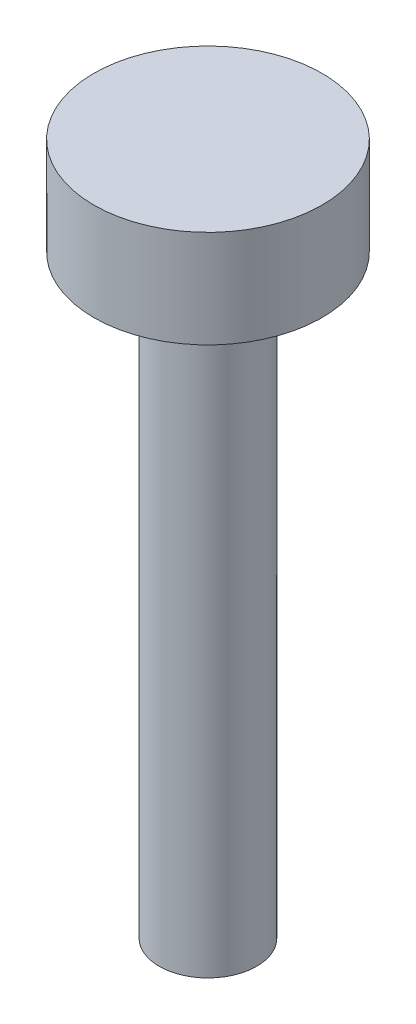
ISO-10303-21;
HEADER;
FILE_DESCRIPTION(('STEP AP214'),'2;1');
FILE_NAME('part.step','',(''),(''),'','','');
FILE_SCHEMA(('AUTOMOTIVE_DESIGN { 1 0 10303 214 1 1 1 1 }'));
ENDSEC;
DATA;
#1=APPLICATION_CONTEXT('core data for automotive mechanical design processes');
#2=APPLICATION_PROTOCOL_DEFINITION('international standard','automotive_design',2000,#1);
#3=PRODUCT_CONTEXT('',#1,'mechanical');
#4=PRODUCT('Part','Part','',(#3));
#5=PRODUCT_RELATED_PRODUCT_CATEGORY('part','',(#4));
#6=PRODUCT_DEFINITION_FORMATION('','',#4);
#7=PRODUCT_DEFINITION_CONTEXT('part definition',#1,'design');
#8=PRODUCT_DEFINITION('design','',#6,#7);
#9=PRODUCT_DEFINITION_SHAPE('','',#8);
#10=(LENGTH_UNIT() NAMED_UNIT(*) SI_UNIT(.MILLI.,.METRE.));
#11=(NAMED_UNIT(*) PLANE_ANGLE_UNIT() SI_UNIT($,.RADIAN.));
#12=(NAMED_UNIT(*) SI_UNIT($,.STERADIAN.) SOLID_ANGLE_UNIT());
#13=UNCERTAINTY_MEASURE_WITH_UNIT(LENGTH_MEASURE(1.E-05),#10,'distance_accuracy_value','');
#14=(GEOMETRIC_REPRESENTATION_CONTEXT(3) GLOBAL_UNCERTAINTY_ASSIGNED_CONTEXT((#13)) GLOBAL_UNIT_ASSIGNED_CONTEXT((#10,
#11,#12)) REPRESENTATION_CONTEXT('',''));
#15=CARTESIAN_POINT('',(0.,0.,0.));
#16=DIRECTION('',(0.,0.,1.));
#17=DIRECTION('',(1.,0.,0.));
#18=AXIS2_PLACEMENT_3D('',#15,#16,#17);
#19=CARTESIAN_POINT('',(0.,4.1656,0.));
#20=DIRECTION('',(0.,-1.,0.));
#21=DIRECTION('',(0.,0.,-1.));
#22=AXIS2_PLACEMENT_3D('',#19,#20,#21);
#23=CYLINDRICAL_SURFACE('',#22,4.8768);
#24=CARTESIAN_POINT('',(0.,4.1656,0.));
#25=DIRECTION('',(0.,1.,0.));
#26=DIRECTION('',(0.,0.,1.));
#27=AXIS2_PLACEMENT_3D('',#24,#25,#26);
#28=CIRCLE('',#27,4.8768);
#29=CARTESIAN_POINT('',(0.,4.1656,4.8768));
#30=VERTEX_POINT('',#29);
#31=EDGE_CURVE('E11',#30,#30,#28,.T.);
#32=ORIENTED_EDGE('',*,*,#31,.F.);
#33=EDGE_LOOP('',(#32));
#34=FACE_BOUND('',#33,.T.);
#35=CARTESIAN_POINT('',(0.,0.,0.));
#36=DIRECTION('',(0.,1.,0.));
#37=DIRECTION('',(0.,0.,1.));
#38=AXIS2_PLACEMENT_3D('',#35,#36,#37);
#39=CIRCLE('',#38,4.8768);
#40=CARTESIAN_POINT('',(0.,0.,4.8768));
#41=VERTEX_POINT('',#40);
#42=EDGE_CURVE('E46',#41,#41,#39,.T.);
#43=ORIENTED_EDGE('',*,*,#42,.T.);
#44=EDGE_LOOP('',(#43));
#45=FACE_BOUND('',#44,.T.);
#46=ADVANCED_FACE('F43',(#34,#45),#23,.T.);
#47=CARTESIAN_POINT('',(0.,4.1656,0.));
#48=DIRECTION('',(0.,1.,0.));
#49=DIRECTION('',(0.,0.,1.));
#50=AXIS2_PLACEMENT_3D('',#47,#48,#49);
#51=PLANE('',#50);
#52=ORIENTED_EDGE('',*,*,#31,.T.);
#53=EDGE_LOOP('',(#52));
#54=FACE_BOUND('',#53,.T.);
#55=ADVANCED_FACE('F58',(#54),#51,.T.);
#56=CARTESIAN_POINT('',(0.,0.,0.));
#57=DIRECTION('',(0.,1.,0.));
#58=DIRECTION('',(0.,0.,1.));
#59=AXIS2_PLACEMENT_3D('',#56,#57,#58);
#60=PLANE('',#59);
#61=ORIENTED_EDGE('',*,*,#42,.F.);
#62=EDGE_LOOP('',(#61));
#63=FACE_BOUND('',#62,.T.);
#64=ADVANCED_FACE('F56',(#63),#60,.F.);
#65=CLOSED_SHELL('',(#46,#55,#64));
#66=MANIFOLD_SOLID_BREP('B2_NOT_SHOWN',#65);
#67=CARTESIAN_POINT('',(0.,1.1176,0.));
#68=DIRECTION('',(0.,1.,0.));
#69=DIRECTION('',(0.,0.,1.));
#70=AXIS2_PLACEMENT_3D('',#67,#68,#69);
#71=TOROIDAL_SURFACE('',#70,2.7686,1.3208);
#72=CARTESIAN_POINT('',(0.,1.1176,0.));
#73=DIRECTION('',(0.,1.,0.));
#74=DIRECTION('',(0.,0.,1.));
#75=AXIS2_PLACEMENT_3D('',#72,#73,#74);
#76=CIRCLE('',#75,4.0894);
#77=CARTESIAN_POINT('',(0.,1.1176,4.0894));
#78=VERTEX_POINT('',#77);
#79=EDGE_CURVE('E348',#78,#78,#76,.T.);
#80=ORIENTED_EDGE('',*,*,#79,.T.);
#81=EDGE_LOOP('',(#80));
#82=FACE_BOUND('',#81,.T.);
#83=CARTESIAN_POINT('',(0.,2.4384,0.));
#84=DIRECTION('',(0.,1.,0.));
#85=DIRECTION('',(0.,0.,1.));
#86=AXIS2_PLACEMENT_3D('',#83,#84,#85);
#87=CIRCLE('',#86,2.7686);
#88=CARTESIAN_POINT('',(-2.71919426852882,2.4384,0.520700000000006));
#89=VERTEX_POINT('',#88);
#90=CARTESIAN_POINT('',(-0.5207,2.4384,2.71919426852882));
#91=VERTEX_POINT('',#90);
#92=EDGE_CURVE('E337',#89,#91,#87,.T.);
#93=ORIENTED_EDGE('',*,*,#92,.F.);
#94=CARTESIAN_POINT('',(-2.18306592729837,2.32988193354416,0.520700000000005));
#95=CARTESIAN_POINT('',(-2.25448450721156,2.35992312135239,0.520700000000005));
#96=CARTESIAN_POINT('',(-2.32846489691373,2.38401979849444,0.520700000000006));
#97=CARTESIAN_POINT('',(-2.47947678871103,2.41952870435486,0.520700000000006));
#98=CARTESIAN_POINT('',(-2.55651171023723,2.43092627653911,0.520700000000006));
#99=CARTESIAN_POINT('',(-2.71142935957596,2.4405699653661,0.520700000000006));
#100=CARTESIAN_POINT('',(-2.78931225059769,2.43881350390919,0.520700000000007));
#101=CARTESIAN_POINT('',(-2.94362553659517,2.42206882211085,0.520700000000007));
#102=CARTESIAN_POINT('',(-3.0200563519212,2.40708449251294,0.520700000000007));
#103=CARTESIAN_POINT('',(-3.16826045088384,2.36449367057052,0.520700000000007));
#104=CARTESIAN_POINT('',(-3.24008079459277,2.3370510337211,0.520700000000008));
#105=CARTESIAN_POINT('',(-3.37798421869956,2.27030190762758,0.520700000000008));
#106=CARTESIAN_POINT('',(-3.4440675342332,2.23099590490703,0.520700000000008));
#107=CARTESIAN_POINT('',(-3.56749017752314,2.14233477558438,0.520700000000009));
#108=CARTESIAN_POINT('',(-3.6249535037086,2.09315222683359,0.520700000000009));
#109=CARTESIAN_POINT('',(-3.73068294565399,1.98573398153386,0.520700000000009));
#110=CARTESIAN_POINT('',(-3.77894972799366,1.92749894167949,0.520700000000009));
#111=CARTESIAN_POINT('',(-3.8643263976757,1.80438005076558,0.520700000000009));
#112=CARTESIAN_POINT('',(-3.90156163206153,1.73958309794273,0.520700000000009));
#113=CARTESIAN_POINT('',(-3.96453276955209,1.60462364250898,0.520700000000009));
#114=CARTESIAN_POINT('',(-3.99026919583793,1.53446138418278,0.520700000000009));
#115=CARTESIAN_POINT('',(-4.02933361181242,1.39131391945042,0.52070000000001));
#116=CARTESIAN_POINT('',(-4.0427505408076,1.31835297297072,0.52070000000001));
#117=CARTESIAN_POINT('',(-4.05710196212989,1.17121398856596,0.52070000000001));
#118=CARTESIAN_POINT('',(-4.05803673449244,1.09703597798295,0.52070000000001));
#119=CARTESIAN_POINT('',(-4.04741365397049,0.949816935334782,0.52070000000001));
#120=CARTESIAN_POINT('',(-4.0358952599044,0.876773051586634,0.52070000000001));
#121=CARTESIAN_POINT('',(-4.00076617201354,0.733654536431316,0.52070000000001));
#122=CARTESIAN_POINT('',(-3.9771555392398,0.663579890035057,0.52070000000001));
#123=CARTESIAN_POINT('',(-3.9185125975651,0.528331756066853,0.520700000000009));
#124=CARTESIAN_POINT('',(-3.88347279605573,0.463161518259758,0.520700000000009));
#125=CARTESIAN_POINT('',(-3.80299560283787,0.339594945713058,0.520700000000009));
#126=CARTESIAN_POINT('',(-3.75755807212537,0.281198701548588,0.520700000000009));
#127=CARTESIAN_POINT('',(-3.65737083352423,0.172543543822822,0.520700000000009));
#128=CARTESIAN_POINT('',(-3.60258015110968,0.122322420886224,0.520700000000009));
#129=CARTESIAN_POINT('',(-3.48540758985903,0.0316994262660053,0.520700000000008));
#130=CARTESIAN_POINT('',(-3.4230254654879,-0.00870212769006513,0.520700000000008));
#131=CARTESIAN_POINT('',(-3.29187377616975,-0.0789308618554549,0.520700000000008));
#132=CARTESIAN_POINT('',(-3.22305360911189,-0.108663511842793,0.520700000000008));
#133=CARTESIAN_POINT('',(-3.08144183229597,-0.156317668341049,0.520700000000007));
#134=CARTESIAN_POINT('',(-3.00865000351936,-0.174238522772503,0.520700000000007));
#135=CARTESIAN_POINT('',(-2.86014599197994,-0.198029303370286,0.520700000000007));
#136=CARTESIAN_POINT('',(-2.78440804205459,-0.203738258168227,0.520700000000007));
#137=CARTESIAN_POINT('',(-2.6330304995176,-0.202581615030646,0.520700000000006));
#138=CARTESIAN_POINT('',(-2.55739091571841,-0.19571495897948,0.520700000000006));
#139=CARTESIAN_POINT('',(-2.40700323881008,-0.169480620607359,0.520700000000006));
#140=CARTESIAN_POINT('',(-2.3322914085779,-0.149905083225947,0.520700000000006));
#141=CARTESIAN_POINT('',(-2.18712405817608,-0.0986855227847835,0.520700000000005));
#142=CARTESIAN_POINT('',(-2.11666900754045,-0.0670401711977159,0.520700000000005));
#143=CARTESIAN_POINT('',(-1.98087535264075,0.00799700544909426,0.520700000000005));
#144=CARTESIAN_POINT('',(-1.91563347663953,0.0515640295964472,0.520700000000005));
#145=CARTESIAN_POINT('',(-1.79336950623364,0.149035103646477,0.520700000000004));
#146=CARTESIAN_POINT('',(-1.73634858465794,0.202940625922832,0.520700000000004));
#147=CARTESIAN_POINT('',(-1.6323265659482,0.319654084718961,0.520700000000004));
#148=CARTESIAN_POINT('',(-1.58532087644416,0.382457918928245,0.520700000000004));
#149=CARTESIAN_POINT('',(-1.50300566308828,0.515323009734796,0.520700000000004));
#150=CARTESIAN_POINT('',(-1.46769295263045,0.585382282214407,0.520700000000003));
#151=CARTESIAN_POINT('',(-1.41143917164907,0.727925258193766,0.520700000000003));
#152=CARTESIAN_POINT('',(-1.38999308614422,0.800209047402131,0.520700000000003));
#153=CARTESIAN_POINT('',(-1.36043658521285,0.947441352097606,0.520700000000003));
#154=CARTESIAN_POINT('',(-1.35231884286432,1.02238838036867,0.520700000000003));
#155=CARTESIAN_POINT('',(-1.34993409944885,1.16793656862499,0.520700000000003));
#156=CARTESIAN_POINT('',(-1.35485702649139,1.23852566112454,0.520700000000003));
#157=CARTESIAN_POINT('',(-1.37659757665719,1.37783968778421,0.520700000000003));
#158=CARTESIAN_POINT('',(-1.3934152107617,1.44656462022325,0.520700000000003));
#159=CARTESIAN_POINT('',(-1.4379876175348,1.57975059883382,0.520700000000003));
#160=CARTESIAN_POINT('',(-1.46565619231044,1.6442406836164,0.520700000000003));
#161=CARTESIAN_POINT('',(-1.53087935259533,1.76802616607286,0.520700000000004));
#162=CARTESIAN_POINT('',(-1.5684385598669,1.82731911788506,0.520700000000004));
#163=CARTESIAN_POINT('',(-1.65456883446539,1.9424935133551,0.520700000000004));
#164=CARTESIAN_POINT('',(-1.70363395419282,1.99800504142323,0.520700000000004));
#165=CARTESIAN_POINT('',(-1.80995536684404,2.10044239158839,0.520700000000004));
#166=CARTESIAN_POINT('',(-1.86720415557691,2.14737599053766,0.520700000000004));
#167=CARTESIAN_POINT('',(-1.96771888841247,2.21724686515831,0.520700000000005));
#168=CARTESIAN_POINT('',(-2.00911589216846,2.24291573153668,0.520700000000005));
#169=CARTESIAN_POINT('',(-2.09436028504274,2.2897988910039,0.520700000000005));
#170=CARTESIAN_POINT('',(-2.13820777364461,2.31101300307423,0.520700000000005));
#171=CARTESIAN_POINT('',(-2.18306592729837,2.32988193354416,0.520700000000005));
#172=B_SPLINE_CURVE_WITH_KNOTS('',3,(#94,#95,#96,#97,#98,#99,#100,#101,#102,#103,#104,#105,#106,
#107,#108,#109,#110,#111,#112,#113,#114,#115,#116,#117,#118,#119,#120,#121,#122,#123,#124,#125,
#126,#127,#128,#129,#130,#131,#132,#133,#134,#135,#136,#137,#138,#139,#140,#141,#142,#143,#144,
#145,#146,#147,#148,#149,#150,#151,#152,#153,#154,#155,#156,#157,#158,#159,#160,#161,#162,#163,
#164,#165,#166,#167,#168,#169,#170,#171),.UNSPECIFIED.,.T.,.F.,(4,2,2,2,2,2,2,2,2,2,2,2,2,2,2,2,
2,2,2,2,2,2,2,2,2,2,2,2,2,2,2,2,2,2,2,2,2,2,4),(0.,0.232264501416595,0.464796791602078,
0.697374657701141,0.929884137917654,1.15942041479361,1.3889472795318,1.61476662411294,
1.84056959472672,2.06369870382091,2.28681765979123,2.50831286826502,2.7298031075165,
2.9505935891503,3.17138295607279,3.39231735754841,3.61325471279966,3.83518603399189,
4.05712453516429,4.28098357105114,4.50485496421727,4.73165958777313,4.95848329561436,
5.18911349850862,5.4197690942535,5.654015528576,5.88829534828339,6.12246750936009,
6.35657580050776,6.58158948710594,6.80647943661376,7.01773182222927,7.22898440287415,
7.43859175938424,7.64829723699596,7.86959808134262,8.09069728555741,8.23657715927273,
8.38246295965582),.UNSPECIFIED.);
#173=CARTESIAN_POINT('',(-2.76757520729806,2.4375444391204,0.520700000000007));
#174=VERTEX_POINT('',#173);
#175=EDGE_CURVE('E407',#89,#174,#172,.T.);
#176=ORIENTED_EDGE('',*,*,#175,.T.);
#177=CARTESIAN_POINT('',(-2.76757367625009,2.43754316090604,-0.520899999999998));
#178=CARTESIAN_POINT('',(-2.76790421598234,2.43781911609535,-0.477492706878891));
#179=CARTESIAN_POINT('',(-2.76812121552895,2.43800028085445,-0.434084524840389));
#180=CARTESIAN_POINT('',(-2.76841277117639,2.43824368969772,-0.34726767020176));
#181=CARTESIAN_POINT('',(-2.76848732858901,2.43830593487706,-0.303858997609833));
#182=CARTESIAN_POINT('',(-2.7686242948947,2.43842028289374,-0.173633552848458));
#183=CARTESIAN_POINT('',(-2.7686000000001,2.43840000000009,-0.0868167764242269));
#184=CARTESIAN_POINT('',(-2.7686000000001,2.43840000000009,0.0868167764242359));
#185=CARTESIAN_POINT('',(-2.7686242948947,2.43842028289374,0.173633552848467));
#186=CARTESIAN_POINT('',(-2.76848732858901,2.43830593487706,0.303858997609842));
#187=CARTESIAN_POINT('',(-2.76841277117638,2.43824368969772,0.347267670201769));
#188=CARTESIAN_POINT('',(-2.76812121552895,2.43800028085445,0.434084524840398));
#189=CARTESIAN_POINT('',(-2.76790421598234,2.43781911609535,0.4774927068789));
#190=CARTESIAN_POINT('',(-2.76757367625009,2.43754316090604,0.520900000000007));
#191=B_SPLINE_CURVE_WITH_KNOTS('',3,(#177,#178,#179,#180,#181,#182,#183,#184,#185,#186,#187,
#188,#189,#190),.UNSPECIFIED.,.F.,.F.,(4,2,2,2,2,2,4),(0.,0.130227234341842,0.260453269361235,
0.520903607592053,0.781353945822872,0.911579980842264,1.04180721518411),.UNSPECIFIED.);
#192=CARTESIAN_POINT('',(-2.76757520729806,2.4375444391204,-0.520699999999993));
#193=VERTEX_POINT('',#192);
#194=EDGE_CURVE('E273',#193,#174,#191,.T.);
#195=ORIENTED_EDGE('',*,*,#194,.F.);
#196=CARTESIAN_POINT('',(-2.18306592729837,2.32988193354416,-0.520699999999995));
#197=CARTESIAN_POINT('',(-2.25448450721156,2.35992312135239,-0.520699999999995));
#198=CARTESIAN_POINT('',(-2.32846489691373,2.38401979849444,-0.520699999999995));
#199=CARTESIAN_POINT('',(-2.47947678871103,2.41952870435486,-0.520699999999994));
#200=CARTESIAN_POINT('',(-2.55651171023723,2.43092627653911,-0.520699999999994));
#201=CARTESIAN_POINT('',(-2.71142935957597,2.4405699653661,-0.520699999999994));
#202=CARTESIAN_POINT('',(-2.7893122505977,2.43881350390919,-0.520699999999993));
#203=CARTESIAN_POINT('',(-2.94362553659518,2.42206882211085,-0.520699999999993));
#204=CARTESIAN_POINT('',(-3.02005635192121,2.40708449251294,-0.520699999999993));
#205=CARTESIAN_POINT('',(-3.16826045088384,2.36449367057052,-0.520699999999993));
#206=CARTESIAN_POINT('',(-3.24008079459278,2.3370510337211,-0.520699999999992));
#207=CARTESIAN_POINT('',(-3.37798421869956,2.27030190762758,-0.520699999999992));
#208=CARTESIAN_POINT('',(-3.4440675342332,2.23099590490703,-0.520699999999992));
#209=CARTESIAN_POINT('',(-3.56749017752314,2.14233477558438,-0.520699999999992));
#210=CARTESIAN_POINT('',(-3.6249535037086,2.09315222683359,-0.520699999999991));
#211=CARTESIAN_POINT('',(-3.730682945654,1.98573398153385,-0.520699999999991));
#212=CARTESIAN_POINT('',(-3.77894972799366,1.92749894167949,-0.520699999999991));
#213=CARTESIAN_POINT('',(-3.86432639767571,1.80438005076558,-0.520699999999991));
#214=CARTESIAN_POINT('',(-3.90156163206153,1.73958309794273,-0.520699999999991));
#215=CARTESIAN_POINT('',(-3.9645327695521,1.60462364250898,-0.520699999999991));
#216=CARTESIAN_POINT('',(-3.99026919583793,1.53446138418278,-0.520699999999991));
#217=CARTESIAN_POINT('',(-4.02933361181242,1.39131391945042,-0.52069999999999));
#218=CARTESIAN_POINT('',(-4.0427505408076,1.31835297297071,-0.52069999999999));
#219=CARTESIAN_POINT('',(-4.05710196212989,1.17121398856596,-0.52069999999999));
#220=CARTESIAN_POINT('',(-4.05803673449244,1.09703597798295,-0.52069999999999));
#221=CARTESIAN_POINT('',(-4.04741365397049,0.94981693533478,-0.52069999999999));
#222=CARTESIAN_POINT('',(-4.0358952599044,0.876773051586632,-0.520699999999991));
#223=CARTESIAN_POINT('',(-4.00076617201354,0.733654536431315,-0.520699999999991));
#224=CARTESIAN_POINT('',(-3.97715553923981,0.663579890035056,-0.520699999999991));
#225=CARTESIAN_POINT('',(-3.9185125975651,0.528331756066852,-0.520699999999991));
#226=CARTESIAN_POINT('',(-3.88347279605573,0.463161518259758,-0.520699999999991));
#227=CARTESIAN_POINT('',(-3.80299560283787,0.339594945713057,-0.520699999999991));
#228=CARTESIAN_POINT('',(-3.75755807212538,0.281198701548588,-0.520699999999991));
#229=CARTESIAN_POINT('',(-3.65737083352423,0.172543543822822,-0.520699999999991));
#230=CARTESIAN_POINT('',(-3.60258015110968,0.122322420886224,-0.520699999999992));
#231=CARTESIAN_POINT('',(-3.48540758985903,0.0316994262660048,-0.520699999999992));
#232=CARTESIAN_POINT('',(-3.4230254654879,-0.00870212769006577,-0.520699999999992));
#233=CARTESIAN_POINT('',(-3.29187377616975,-0.0789308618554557,-0.520699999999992));
#234=CARTESIAN_POINT('',(-3.22305360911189,-0.108663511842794,-0.520699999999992));
#235=CARTESIAN_POINT('',(-3.08144183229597,-0.15631766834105,-0.520699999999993));
#236=CARTESIAN_POINT('',(-3.00865000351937,-0.174238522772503,-0.520699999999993));
#237=CARTESIAN_POINT('',(-2.86014599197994,-0.198029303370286,-0.520699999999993));
#238=CARTESIAN_POINT('',(-2.78440804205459,-0.203738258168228,-0.520699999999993));
#239=CARTESIAN_POINT('',(-2.6330304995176,-0.202581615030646,-0.520699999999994));
#240=CARTESIAN_POINT('',(-2.55739091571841,-0.19571495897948,-0.520699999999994));
#241=CARTESIAN_POINT('',(-2.40700323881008,-0.169480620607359,-0.520699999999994));
#242=CARTESIAN_POINT('',(-2.33229140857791,-0.149905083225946,-0.520699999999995));
#243=CARTESIAN_POINT('',(-2.18712405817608,-0.0986855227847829,-0.520699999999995));
#244=CARTESIAN_POINT('',(-2.11666900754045,-0.0670401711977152,-0.520699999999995));
#245=CARTESIAN_POINT('',(-1.98087535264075,0.00799700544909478,-0.520699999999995));
#246=CARTESIAN_POINT('',(-1.91563347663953,0.0515640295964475,-0.520699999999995));
#247=CARTESIAN_POINT('',(-1.79336950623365,0.149035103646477,-0.520699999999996));
#248=CARTESIAN_POINT('',(-1.73634858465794,0.202940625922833,-0.520699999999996));
#249=CARTESIAN_POINT('',(-1.63232656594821,0.319654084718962,-0.520699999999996));
#250=CARTESIAN_POINT('',(-1.58532087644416,0.382457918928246,-0.520699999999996));
#251=CARTESIAN_POINT('',(-1.50300566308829,0.515323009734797,-0.520699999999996));
#252=CARTESIAN_POINT('',(-1.46769295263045,0.585382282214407,-0.520699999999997));
#253=CARTESIAN_POINT('',(-1.41143917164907,0.727925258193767,-0.520699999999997));
#254=CARTESIAN_POINT('',(-1.38999308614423,0.800209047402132,-0.520699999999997));
#255=CARTESIAN_POINT('',(-1.36043658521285,0.947441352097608,-0.520699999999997));
#256=CARTESIAN_POINT('',(-1.35231884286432,1.02238838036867,-0.520699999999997));
#257=CARTESIAN_POINT('',(-1.34993409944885,1.16793656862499,-0.520699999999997));
#258=CARTESIAN_POINT('',(-1.35485702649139,1.23852566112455,-0.520699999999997));
#259=CARTESIAN_POINT('',(-1.37659757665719,1.37783968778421,-0.520699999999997));
#260=CARTESIAN_POINT('',(-1.3934152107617,1.44656462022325,-0.520699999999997));
#261=CARTESIAN_POINT('',(-1.43798761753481,1.57975059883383,-0.520699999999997));
#262=CARTESIAN_POINT('',(-1.46565619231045,1.6442406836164,-0.520699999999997));
#263=CARTESIAN_POINT('',(-1.53087935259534,1.76802616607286,-0.520699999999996));
#264=CARTESIAN_POINT('',(-1.56843855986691,1.82731911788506,-0.520699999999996));
#265=CARTESIAN_POINT('',(-1.65456883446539,1.9424935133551,-0.520699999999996));
#266=CARTESIAN_POINT('',(-1.70363395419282,1.99800504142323,-0.520699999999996));
#267=CARTESIAN_POINT('',(-1.80995536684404,2.10044239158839,-0.520699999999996));
#268=CARTESIAN_POINT('',(-1.86720415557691,2.14737599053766,-0.520699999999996));
#269=CARTESIAN_POINT('',(-1.96771888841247,2.21724686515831,-0.520699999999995));
#270=CARTESIAN_POINT('',(-2.00911589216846,2.24291573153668,-0.520699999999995));
#271=CARTESIAN_POINT('',(-2.09436028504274,2.2897988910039,-0.520699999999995));
#272=CARTESIAN_POINT('',(-2.13820777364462,2.31101300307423,-0.520699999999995));
#273=CARTESIAN_POINT('',(-2.18306592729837,2.32988193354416,-0.520699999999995));
#274=B_SPLINE_CURVE_WITH_KNOTS('',3,(#196,#197,#198,#199,#200,#201,#202,#203,#204,#205,#206,
#207,#208,#209,#210,#211,#212,#213,#214,#215,#216,#217,#218,#219,#220,#221,#222,#223,#224,#225,
#226,#227,#228,#229,#230,#231,#232,#233,#234,#235,#236,#237,#238,#239,#240,#241,#242,#243,#244,
#245,#246,#247,#248,#249,#250,#251,#252,#253,#254,#255,#256,#257,#258,#259,#260,#261,#262,#263,
#264,#265,#266,#267,#268,#269,#270,#271,#272,#273),.UNSPECIFIED.,.T.,.F.,(4,2,2,2,2,2,2,2,2,2,2,
2,2,2,2,2,2,2,2,2,2,2,2,2,2,2,2,2,2,2,2,2,2,2,2,2,2,2,4),(0.,0.232264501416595,
0.464796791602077,0.697374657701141,0.929884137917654,1.15942041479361,1.3889472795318,
1.61476662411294,1.84056959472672,2.06369870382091,2.28681765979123,2.50831286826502,
2.7298031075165,2.9505935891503,3.17138295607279,3.39231735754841,3.61325471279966,
3.83518603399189,4.05712453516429,4.28098357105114,4.50485496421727,4.73165958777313,
4.95848329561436,5.18911349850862,5.41976909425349,5.654015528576,5.88829534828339,
6.12246750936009,6.35657580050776,6.58158948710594,6.80647943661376,7.01773182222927,
7.22898440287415,7.43859175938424,7.64829723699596,7.86959808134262,8.09069728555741,
8.23657715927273,8.38246295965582),.UNSPECIFIED.);
#275=CARTESIAN_POINT('',(-2.71919426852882,2.4384,-0.520699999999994));
#276=VERTEX_POINT('',#275);
#277=EDGE_CURVE('E249',#276,#193,#274,.T.);
#278=ORIENTED_EDGE('',*,*,#277,.F.);
#279=CARTESIAN_POINT('',(-0.5207,2.4384,-2.71919426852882));
#280=VERTEX_POINT('',#279);
#281=EDGE_CURVE('E343',#280,#276,#87,.T.);
#282=ORIENTED_EDGE('',*,*,#281,.F.);
#283=CARTESIAN_POINT('',(-0.5207,2.32988193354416,-2.18306592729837));
#284=CARTESIAN_POINT('',(-0.5207,2.35992312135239,-2.25448450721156));
#285=CARTESIAN_POINT('',(-0.5207,2.38401979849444,-2.32846489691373));
#286=CARTESIAN_POINT('',(-0.5207,2.41952870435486,-2.47947678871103));
#287=CARTESIAN_POINT('',(-0.5207,2.43092627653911,-2.55651171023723));
#288=CARTESIAN_POINT('',(-0.5207,2.4405699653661,-2.71142935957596));
#289=CARTESIAN_POINT('',(-0.5207,2.43881350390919,-2.78931225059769));
#290=CARTESIAN_POINT('',(-0.5207,2.42206882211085,-2.94362553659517));
#291=CARTESIAN_POINT('',(-0.5207,2.40708449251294,-3.0200563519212));
#292=CARTESIAN_POINT('',(-0.5207,2.36449367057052,-3.16826045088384));
#293=CARTESIAN_POINT('',(-0.5207,2.3370510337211,-3.24008079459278));
#294=CARTESIAN_POINT('',(-0.5207,2.27030190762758,-3.37798421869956));
#295=CARTESIAN_POINT('',(-0.5207,2.23099590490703,-3.4440675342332));
#296=CARTESIAN_POINT('',(-0.5207,2.14233477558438,-3.56749017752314));
#297=CARTESIAN_POINT('',(-0.5207,2.09315222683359,-3.6249535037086));
#298=CARTESIAN_POINT('',(-0.5207,1.98573398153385,-3.73068294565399));
#299=CARTESIAN_POINT('',(-0.5207,1.92749894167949,-3.77894972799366));
#300=CARTESIAN_POINT('',(-0.5207,1.80438005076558,-3.8643263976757));
#301=CARTESIAN_POINT('',(-0.5207,1.73958309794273,-3.90156163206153));
#302=CARTESIAN_POINT('',(-0.5207,1.60462364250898,-3.96453276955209));
#303=CARTESIAN_POINT('',(-0.5207,1.53446138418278,-3.99026919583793));
#304=CARTESIAN_POINT('',(-0.5207,1.39131391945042,-4.02933361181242));
#305=CARTESIAN_POINT('',(-0.5207,1.31835297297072,-4.0427505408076));
#306=CARTESIAN_POINT('',(-0.5207,1.17121398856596,-4.05710196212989));
#307=CARTESIAN_POINT('',(-0.5207,1.09703597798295,-4.05803673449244));
#308=CARTESIAN_POINT('',(-0.5207,0.949816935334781,-4.04741365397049));
#309=CARTESIAN_POINT('',(-0.5207,0.876773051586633,-4.0358952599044));
#310=CARTESIAN_POINT('',(-0.5207,0.733654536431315,-4.00076617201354));
#311=CARTESIAN_POINT('',(-0.5207,0.663579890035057,-3.97715553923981));
#312=CARTESIAN_POINT('',(-0.5207,0.528331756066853,-3.9185125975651));
#313=CARTESIAN_POINT('',(-0.5207,0.463161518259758,-3.88347279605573));
#314=CARTESIAN_POINT('',(-0.5207,0.339594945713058,-3.80299560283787));
#315=CARTESIAN_POINT('',(-0.5207,0.281198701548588,-3.75755807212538));
#316=CARTESIAN_POINT('',(-0.5207,0.172543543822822,-3.65737083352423));
#317=CARTESIAN_POINT('',(-0.5207,0.122322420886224,-3.60258015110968));
#318=CARTESIAN_POINT('',(-0.5207,0.0316994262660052,-3.48540758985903));
#319=CARTESIAN_POINT('',(-0.5207,-0.00870212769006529,-3.4230254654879));
#320=CARTESIAN_POINT('',(-0.5207,-0.0789308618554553,-3.29187377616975));
#321=CARTESIAN_POINT('',(-0.5207,-0.108663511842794,-3.22305360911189));
#322=CARTESIAN_POINT('',(-0.5207,-0.15631766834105,-3.08144183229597));
#323=CARTESIAN_POINT('',(-0.5207,-0.174238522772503,-3.00865000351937));
#324=CARTESIAN_POINT('',(-0.5207,-0.198029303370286,-2.86014599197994));
#325=CARTESIAN_POINT('',(-0.5207,-0.203738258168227,-2.78440804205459));
#326=CARTESIAN_POINT('',(-0.5207,-0.202581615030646,-2.6330304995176));
#327=CARTESIAN_POINT('',(-0.5207,-0.19571495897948,-2.55739091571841));
#328=CARTESIAN_POINT('',(-0.5207,-0.169480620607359,-2.40700323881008));
#329=CARTESIAN_POINT('',(-0.5207,-0.149905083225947,-2.33229140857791));
#330=CARTESIAN_POINT('',(-0.5207,-0.0986855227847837,-2.18712405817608));
#331=CARTESIAN_POINT('',(-0.5207,-0.0670401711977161,-2.11666900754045));
#332=CARTESIAN_POINT('',(-0.5207,0.00799700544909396,-1.98087535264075));
#333=CARTESIAN_POINT('',(-0.5207,0.0515640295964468,-1.91563347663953));
#334=CARTESIAN_POINT('',(-0.5207,0.149035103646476,-1.79336950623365));
#335=CARTESIAN_POINT('',(-0.5207,0.202940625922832,-1.73634858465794));
#336=CARTESIAN_POINT('',(-0.5207,0.319654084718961,-1.63232656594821));
#337=CARTESIAN_POINT('',(-0.5207,0.382457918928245,-1.58532087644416));
#338=CARTESIAN_POINT('',(-0.5207,0.515323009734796,-1.50300566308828));
#339=CARTESIAN_POINT('',(-0.5207,0.585382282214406,-1.46769295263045));
#340=CARTESIAN_POINT('',(-0.5207,0.727925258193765,-1.41143917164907));
#341=CARTESIAN_POINT('',(-0.5207,0.800209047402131,-1.38999308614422));
#342=CARTESIAN_POINT('',(-0.5207,0.947441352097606,-1.36043658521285));
#343=CARTESIAN_POINT('',(-0.5207,1.02238838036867,-1.35231884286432));
#344=CARTESIAN_POINT('',(-0.5207,1.16793656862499,-1.34993409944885));
#345=CARTESIAN_POINT('',(-0.5207,1.23852566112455,-1.35485702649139));
#346=CARTESIAN_POINT('',(-0.5207,1.37783968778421,-1.37659757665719));
#347=CARTESIAN_POINT('',(-0.5207,1.44656462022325,-1.3934152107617));
#348=CARTESIAN_POINT('',(-0.5207,1.57975059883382,-1.43798761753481));
#349=CARTESIAN_POINT('',(-0.5207,1.6442406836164,-1.46565619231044));
#350=CARTESIAN_POINT('',(-0.5207,1.76802616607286,-1.53087935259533));
#351=CARTESIAN_POINT('',(-0.5207,1.82731911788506,-1.5684385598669));
#352=CARTESIAN_POINT('',(-0.5207,1.9424935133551,-1.65456883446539));
#353=CARTESIAN_POINT('',(-0.5207,1.99800504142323,-1.70363395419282));
#354=CARTESIAN_POINT('',(-0.5207,2.10044239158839,-1.80995536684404));
#355=CARTESIAN_POINT('',(-0.5207,2.14737599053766,-1.86720415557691));
#356=CARTESIAN_POINT('',(-0.5207,2.21724686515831,-1.96771888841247));
#357=CARTESIAN_POINT('',(-0.5207,2.24291573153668,-2.00911589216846));
#358=CARTESIAN_POINT('',(-0.5207,2.2897988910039,-2.09436028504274));
#359=CARTESIAN_POINT('',(-0.5207,2.31101300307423,-2.13820777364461));
#360=CARTESIAN_POINT('',(-0.5207,2.32988193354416,-2.18306592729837));
#361=B_SPLINE_CURVE_WITH_KNOTS('',3,(#283,#284,#285,#286,#287,#288,#289,#290,#291,#292,#293,
#294,#295,#296,#297,#298,#299,#300,#301,#302,#303,#304,#305,#306,#307,#308,#309,#310,#311,#312,
#313,#314,#315,#316,#317,#318,#319,#320,#321,#322,#323,#324,#325,#326,#327,#328,#329,#330,#331,
#332,#333,#334,#335,#336,#337,#338,#339,#340,#341,#342,#343,#344,#345,#346,#347,#348,#349,#350,
#351,#352,#353,#354,#355,#356,#357,#358,#359,#360),.UNSPECIFIED.,.T.,.F.,(4,2,2,2,2,2,2,2,2,2,2,
2,2,2,2,2,2,2,2,2,2,2,2,2,2,2,2,2,2,2,2,2,2,2,2,2,2,2,4),(0.,0.232264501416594,
0.464796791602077,0.69737465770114,0.929884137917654,1.15942041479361,1.3889472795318,
1.61476662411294,1.84056959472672,2.06369870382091,2.28681765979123,2.50831286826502,
2.7298031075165,2.9505935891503,3.17138295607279,3.39231735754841,3.61325471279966,
3.83518603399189,4.05712453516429,4.28098357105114,4.50485496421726,4.73165958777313,
4.95848329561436,5.18911349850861,5.41976909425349,5.65401552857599,5.88829534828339,
6.12246750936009,6.35657580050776,6.58158948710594,6.80647943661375,7.01773182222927,
7.22898440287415,7.43859175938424,7.64829723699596,7.86959808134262,8.09069728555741,
8.23657715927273,8.38246295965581),.UNSPECIFIED.);
#362=CARTESIAN_POINT('',(-0.5207,2.4375444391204,-2.76757520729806));
#363=VERTEX_POINT('',#362);
#364=EDGE_CURVE('E392',#280,#363,#361,.T.);
#365=ORIENTED_EDGE('',*,*,#364,.T.);
#366=CARTESIAN_POINT('',(0.5209,2.43754316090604,-2.76757367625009));
#367=CARTESIAN_POINT('',(0.477492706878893,2.43781911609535,-2.76790421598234));
#368=CARTESIAN_POINT('',(0.434084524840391,2.43800028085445,-2.76812121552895));
#369=CARTESIAN_POINT('',(0.347267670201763,2.43824368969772,-2.76841277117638));
#370=CARTESIAN_POINT('',(0.303858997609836,2.43830593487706,-2.76848732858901));
#371=CARTESIAN_POINT('',(0.173633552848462,2.43842028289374,-2.7686242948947));
#372=CARTESIAN_POINT('',(0.0868167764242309,2.43840000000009,-2.7686000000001));
#373=CARTESIAN_POINT('',(-0.086816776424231,2.43840000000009,-2.7686000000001));
#374=CARTESIAN_POINT('',(-0.173633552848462,2.43842028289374,-2.7686242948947));
#375=CARTESIAN_POINT('',(-0.303858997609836,2.43830593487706,-2.76848732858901));
#376=CARTESIAN_POINT('',(-0.347267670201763,2.43824368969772,-2.76841277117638));
#377=CARTESIAN_POINT('',(-0.434084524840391,2.43800028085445,-2.76812121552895));
#378=CARTESIAN_POINT('',(-0.477492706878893,2.43781911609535,-2.76790421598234));
#379=CARTESIAN_POINT('',(-0.5209,2.43754316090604,-2.76757367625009));
#380=B_SPLINE_CURVE_WITH_KNOTS('',3,(#366,#367,#368,#369,#370,#371,#372,#373,#374,#375,#376,
#377,#378,#379),.UNSPECIFIED.,.F.,.F.,(4,2,2,2,2,2,4),(0.,0.130227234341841,0.260453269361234,
0.520903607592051,0.781353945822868,0.91157998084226,1.0418072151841),.UNSPECIFIED.);
#381=CARTESIAN_POINT('',(0.5207,2.4375444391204,-2.76757520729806));
#382=VERTEX_POINT('',#381);
#383=EDGE_CURVE('E331',#382,#363,#380,.T.);
#384=ORIENTED_EDGE('',*,*,#383,.F.);
#385=CARTESIAN_POINT('',(0.5207,2.32988193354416,-2.18306592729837));
#386=CARTESIAN_POINT('',(0.5207,2.35992312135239,-2.25448450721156));
#387=CARTESIAN_POINT('',(0.5207,2.38401979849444,-2.32846489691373));
#388=CARTESIAN_POINT('',(0.5207,2.41952870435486,-2.47947678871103));
#389=CARTESIAN_POINT('',(0.5207,2.43092627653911,-2.55651171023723));
#390=CARTESIAN_POINT('',(0.5207,2.4405699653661,-2.71142935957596));
#391=CARTESIAN_POINT('',(0.5207,2.43881350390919,-2.78931225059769));
#392=CARTESIAN_POINT('',(0.5207,2.42206882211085,-2.94362553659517));
#393=CARTESIAN_POINT('',(0.5207,2.40708449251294,-3.0200563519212));
#394=CARTESIAN_POINT('',(0.5207,2.36449367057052,-3.16826045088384));
#395=CARTESIAN_POINT('',(0.5207,2.3370510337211,-3.24008079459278));
#396=CARTESIAN_POINT('',(0.5207,2.27030190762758,-3.37798421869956));
#397=CARTESIAN_POINT('',(0.5207,2.23099590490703,-3.4440675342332));
#398=CARTESIAN_POINT('',(0.5207,2.14233477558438,-3.56749017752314));
#399=CARTESIAN_POINT('',(0.5207,2.09315222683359,-3.6249535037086));
#400=CARTESIAN_POINT('',(0.5207,1.98573398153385,-3.73068294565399));
#401=CARTESIAN_POINT('',(0.5207,1.92749894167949,-3.77894972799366));
#402=CARTESIAN_POINT('',(0.5207,1.80438005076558,-3.8643263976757));
#403=CARTESIAN_POINT('',(0.5207,1.73958309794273,-3.90156163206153));
#404=CARTESIAN_POINT('',(0.5207,1.60462364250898,-3.96453276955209));
#405=CARTESIAN_POINT('',(0.5207,1.53446138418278,-3.99026919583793));
#406=CARTESIAN_POINT('',(0.5207,1.39131391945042,-4.02933361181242));
#407=CARTESIAN_POINT('',(0.5207,1.31835297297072,-4.0427505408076));
#408=CARTESIAN_POINT('',(0.5207,1.17121398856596,-4.05710196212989));
#409=CARTESIAN_POINT('',(0.5207,1.09703597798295,-4.05803673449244));
#410=CARTESIAN_POINT('',(0.5207,0.949816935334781,-4.04741365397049));
#411=CARTESIAN_POINT('',(0.5207,0.876773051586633,-4.0358952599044));
#412=CARTESIAN_POINT('',(0.5207,0.733654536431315,-4.00076617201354));
#413=CARTESIAN_POINT('',(0.5207,0.663579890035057,-3.97715553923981));
#414=CARTESIAN_POINT('',(0.5207,0.528331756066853,-3.9185125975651));
#415=CARTESIAN_POINT('',(0.5207,0.463161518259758,-3.88347279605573));
#416=CARTESIAN_POINT('',(0.5207,0.339594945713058,-3.80299560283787));
#417=CARTESIAN_POINT('',(0.5207,0.281198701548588,-3.75755807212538));
#418=CARTESIAN_POINT('',(0.5207,0.172543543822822,-3.65737083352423));
#419=CARTESIAN_POINT('',(0.5207,0.122322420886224,-3.60258015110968));
#420=CARTESIAN_POINT('',(0.5207,0.0316994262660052,-3.48540758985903));
#421=CARTESIAN_POINT('',(0.5207,-0.00870212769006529,-3.4230254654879));
#422=CARTESIAN_POINT('',(0.5207,-0.0789308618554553,-3.29187377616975));
#423=CARTESIAN_POINT('',(0.5207,-0.108663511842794,-3.22305360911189));
#424=CARTESIAN_POINT('',(0.5207,-0.15631766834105,-3.08144183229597));
#425=CARTESIAN_POINT('',(0.5207,-0.174238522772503,-3.00865000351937));
#426=CARTESIAN_POINT('',(0.5207,-0.198029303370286,-2.86014599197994));
#427=CARTESIAN_POINT('',(0.5207,-0.203738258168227,-2.78440804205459));
#428=CARTESIAN_POINT('',(0.5207,-0.202581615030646,-2.6330304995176));
#429=CARTESIAN_POINT('',(0.5207,-0.19571495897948,-2.55739091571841));
#430=CARTESIAN_POINT('',(0.5207,-0.169480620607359,-2.40700323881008));
#431=CARTESIAN_POINT('',(0.5207,-0.149905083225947,-2.33229140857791));
#432=CARTESIAN_POINT('',(0.5207,-0.0986855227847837,-2.18712405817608));
#433=CARTESIAN_POINT('',(0.5207,-0.0670401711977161,-2.11666900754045));
#434=CARTESIAN_POINT('',(0.5207,0.00799700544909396,-1.98087535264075));
#435=CARTESIAN_POINT('',(0.5207,0.0515640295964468,-1.91563347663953));
#436=CARTESIAN_POINT('',(0.5207,0.149035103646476,-1.79336950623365));
#437=CARTESIAN_POINT('',(0.5207,0.202940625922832,-1.73634858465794));
#438=CARTESIAN_POINT('',(0.5207,0.319654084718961,-1.63232656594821));
#439=CARTESIAN_POINT('',(0.5207,0.382457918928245,-1.58532087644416));
#440=CARTESIAN_POINT('',(0.5207,0.515323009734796,-1.50300566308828));
#441=CARTESIAN_POINT('',(0.5207,0.585382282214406,-1.46769295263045));
#442=CARTESIAN_POINT('',(0.5207,0.727925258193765,-1.41143917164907));
#443=CARTESIAN_POINT('',(0.5207,0.800209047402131,-1.38999308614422));
#444=CARTESIAN_POINT('',(0.5207,0.947441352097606,-1.36043658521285));
#445=CARTESIAN_POINT('',(0.5207,1.02238838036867,-1.35231884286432));
#446=CARTESIAN_POINT('',(0.5207,1.16793656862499,-1.34993409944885));
#447=CARTESIAN_POINT('',(0.5207,1.23852566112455,-1.35485702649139));
#448=CARTESIAN_POINT('',(0.5207,1.37783968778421,-1.37659757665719));
#449=CARTESIAN_POINT('',(0.5207,1.44656462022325,-1.3934152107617));
#450=CARTESIAN_POINT('',(0.5207,1.57975059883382,-1.43798761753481));
#451=CARTESIAN_POINT('',(0.5207,1.6442406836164,-1.46565619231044));
#452=CARTESIAN_POINT('',(0.5207,1.76802616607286,-1.53087935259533));
#453=CARTESIAN_POINT('',(0.5207,1.82731911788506,-1.5684385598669));
#454=CARTESIAN_POINT('',(0.5207,1.9424935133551,-1.65456883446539));
#455=CARTESIAN_POINT('',(0.5207,1.99800504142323,-1.70363395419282));
#456=CARTESIAN_POINT('',(0.5207,2.10044239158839,-1.80995536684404));
#457=CARTESIAN_POINT('',(0.5207,2.14737599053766,-1.86720415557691));
#458=CARTESIAN_POINT('',(0.5207,2.21724686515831,-1.96771888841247));
#459=CARTESIAN_POINT('',(0.5207,2.24291573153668,-2.00911589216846));
#460=CARTESIAN_POINT('',(0.5207,2.2897988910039,-2.09436028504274));
#461=CARTESIAN_POINT('',(0.5207,2.31101300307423,-2.13820777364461));
#462=CARTESIAN_POINT('',(0.5207,2.32988193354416,-2.18306592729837));
#463=B_SPLINE_CURVE_WITH_KNOTS('',3,(#385,#386,#387,#388,#389,#390,#391,#392,#393,#394,#395,
#396,#397,#398,#399,#400,#401,#402,#403,#404,#405,#406,#407,#408,#409,#410,#411,#412,#413,#414,
#415,#416,#417,#418,#419,#420,#421,#422,#423,#424,#425,#426,#427,#428,#429,#430,#431,#432,#433,
#434,#435,#436,#437,#438,#439,#440,#441,#442,#443,#444,#445,#446,#447,#448,#449,#450,#451,#452,
#453,#454,#455,#456,#457,#458,#459,#460,#461,#462),.UNSPECIFIED.,.T.,.F.,(4,2,2,2,2,2,2,2,2,2,2,
2,2,2,2,2,2,2,2,2,2,2,2,2,2,2,2,2,2,2,2,2,2,2,2,2,2,2,4),(0.,0.232264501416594,
0.464796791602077,0.69737465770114,0.929884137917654,1.15942041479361,1.3889472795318,
1.61476662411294,1.84056959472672,2.06369870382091,2.28681765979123,2.50831286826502,
2.7298031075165,2.9505935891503,3.17138295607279,3.39231735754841,3.61325471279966,
3.83518603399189,4.05712453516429,4.28098357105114,4.50485496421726,4.73165958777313,
4.95848329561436,5.18911349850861,5.41976909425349,5.65401552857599,5.88829534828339,
6.12246750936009,6.35657580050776,6.58158948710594,6.80647943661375,7.01773182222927,
7.22898440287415,7.43859175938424,7.64829723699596,7.86959808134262,8.09069728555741,
8.23657715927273,8.38246295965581),.UNSPECIFIED.);
#464=CARTESIAN_POINT('',(0.5207,2.4384,-2.71919426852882));
#465=VERTEX_POINT('',#464);
#466=EDGE_CURVE('E310',#465,#382,#463,.T.);
#467=ORIENTED_EDGE('',*,*,#466,.F.);
#468=CARTESIAN_POINT('',(2.71919426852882,2.4384,-0.520700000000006));
#469=VERTEX_POINT('',#468);
#470=EDGE_CURVE('E346',#469,#465,#87,.T.);
#471=ORIENTED_EDGE('',*,*,#470,.F.);
#472=CARTESIAN_POINT('',(1.44556262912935,1.5934152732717,-0.520700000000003));
#473=CARTESIAN_POINT('',(1.41892409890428,1.52850984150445,-0.520700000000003));
#474=CARTESIAN_POINT('',(1.39757175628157,1.46139520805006,-0.520700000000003));
#475=CARTESIAN_POINT('',(1.36638921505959,1.32450672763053,-0.520700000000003));
#476=CARTESIAN_POINT('',(1.35656398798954,1.25473174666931,-0.520700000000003));
#477=CARTESIAN_POINT('',(1.34892948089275,1.1144775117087,-0.520700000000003));
#478=CARTESIAN_POINT('',(1.3511273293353,1.04399786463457,-0.520700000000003));
#479=CARTESIAN_POINT('',(1.36744453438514,0.904444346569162,-0.520700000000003));
#480=CARTESIAN_POINT('',(1.38156372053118,0.835370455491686,-0.520700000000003));
#481=CARTESIAN_POINT('',(1.42090250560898,0.701033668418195,-0.520700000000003));
#482=CARTESIAN_POINT('',(1.44603958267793,0.635746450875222,-0.520700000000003));
#483=CARTESIAN_POINT('',(1.50639257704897,0.5100154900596,-0.520700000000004));
#484=CARTESIAN_POINT('',(1.54161099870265,0.449572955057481,-0.520700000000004));
#485=CARTESIAN_POINT('',(1.62298545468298,0.331961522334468,-0.520700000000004));
#486=CARTESIAN_POINT('',(1.66960526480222,0.275113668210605,-0.520700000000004));
#487=CARTESIAN_POINT('',(1.77128500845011,0.169548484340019,-0.520700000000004));
#488=CARTESIAN_POINT('',(1.82634691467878,0.120833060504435,-0.520700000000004));
#489=CARTESIAN_POINT('',(1.94654502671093,0.0303285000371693,-0.520700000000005));
#490=CARTESIAN_POINT('',(2.01205968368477,-0.0109590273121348,-0.520700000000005));
#491=CARTESIAN_POINT('',(2.14900807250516,-0.0821577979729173,-0.520700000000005));
#492=CARTESIAN_POINT('',(2.22044246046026,-0.112067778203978,-0.520700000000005));
#493=CARTESIAN_POINT('',(2.36846775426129,-0.160018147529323,-0.520700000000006));
#494=CARTESIAN_POINT('',(2.44512296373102,-0.177860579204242,-0.520700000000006));
#495=CARTESIAN_POINT('',(2.60035293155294,-0.200278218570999,-0.520700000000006));
#496=CARTESIAN_POINT('',(2.67892762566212,-0.204853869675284,-0.520700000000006));
#497=CARTESIAN_POINT('',(2.83489551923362,-0.200506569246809,-0.520700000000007));
#498=CARTESIAN_POINT('',(2.9122925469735,-0.191722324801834,-0.520700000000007));
#499=CARTESIAN_POINT('',(3.06444653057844,-0.161047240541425,-0.520700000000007));
#500=CARTESIAN_POINT('',(3.13920371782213,-0.139157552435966,-0.520700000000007));
#501=CARTESIAN_POINT('',(3.28256518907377,-0.0833110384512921,-0.520700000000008));
#502=CARTESIAN_POINT('',(3.35125400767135,-0.0495711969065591,-0.520700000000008));
#503=CARTESIAN_POINT('',(3.48186990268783,0.0291326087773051,-0.520700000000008));
#504=CARTESIAN_POINT('',(3.5437975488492,0.0740956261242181,-0.520700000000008));
#505=CARTESIAN_POINT('',(3.65814644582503,0.173221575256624,-0.520700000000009));
#506=CARTESIAN_POINT('',(3.71069753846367,0.227234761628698,-0.520700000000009));
#507=CARTESIAN_POINT('',(3.80586708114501,0.343399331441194,-0.520700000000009));
#508=CARTESIAN_POINT('',(3.84848614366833,0.405550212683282,-0.520700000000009));
#509=CARTESIAN_POINT('',(3.92212083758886,0.535510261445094,-0.520700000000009));
#510=CARTESIAN_POINT('',(3.95325461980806,0.603252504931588,-0.520700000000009));
#511=CARTESIAN_POINT('',(4.00362732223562,0.743023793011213,-0.52070000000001));
#512=CARTESIAN_POINT('',(4.02286669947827,0.815052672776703,-0.52070000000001));
#513=CARTESIAN_POINT('',(4.04879947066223,0.960877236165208,-0.52070000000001));
#514=CARTESIAN_POINT('',(4.05556910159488,1.03465937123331,-0.52070000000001));
#515=CARTESIAN_POINT('',(4.05659623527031,1.18231004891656,-0.52070000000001));
#516=CARTESIAN_POINT('',(4.05085396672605,1.25617858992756,-0.52070000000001));
#517=CARTESIAN_POINT('',(4.02705220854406,1.40174129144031,-0.52070000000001));
#518=CARTESIAN_POINT('',(4.0090189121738,1.47343973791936,-0.52070000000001));
#519=CARTESIAN_POINT('',(3.96119030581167,1.61279855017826,-0.52070000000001));
#520=CARTESIAN_POINT('',(3.93139499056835,1.68045891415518,-0.520700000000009));
#521=CARTESIAN_POINT('',(3.86085135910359,1.80995083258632,-0.520700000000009));
#522=CARTESIAN_POINT('',(3.82008488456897,1.87177249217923,-0.520700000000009));
#523=CARTESIAN_POINT('',(3.72880492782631,1.98774128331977,-0.520700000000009));
#524=CARTESIAN_POINT('',(3.67829127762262,2.0418882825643,-0.520700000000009));
#525=CARTESIAN_POINT('',(3.56866335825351,2.14130786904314,-0.520700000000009));
#526=CARTESIAN_POINT('',(3.50950276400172,2.1865293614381,-0.520700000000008));
#527=CARTESIAN_POINT('',(3.38449057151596,2.26650923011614,-0.520700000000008));
#528=CARTESIAN_POINT('',(3.31863870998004,2.30126719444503,-0.520700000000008));
#529=CARTESIAN_POINT('',(3.18143035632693,2.35971705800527,-0.520700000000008));
#530=CARTESIAN_POINT('',(3.11002614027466,2.38329688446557,-0.520700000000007));
#531=CARTESIAN_POINT('',(2.96430325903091,2.4183176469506,-0.520700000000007));
#532=CARTESIAN_POINT('',(2.88998440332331,2.42975778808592,-0.520700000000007));
#533=CARTESIAN_POINT('',(2.73941152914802,2.44036460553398,-0.520700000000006));
#534=CARTESIAN_POINT('',(2.66314502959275,2.43935381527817,-0.520700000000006));
#535=CARTESIAN_POINT('',(2.51182768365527,2.4247693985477,-0.520700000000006));
#536=CARTESIAN_POINT('',(2.43677689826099,2.41119514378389,-0.520700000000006));
#537=CARTESIAN_POINT('',(2.28864992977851,2.37161484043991,-0.520700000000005));
#538=CARTESIAN_POINT('',(2.2156295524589,2.34539992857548,-0.520700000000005));
#539=CARTESIAN_POINT('',(2.07490988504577,2.28123820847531,-0.520700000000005));
#540=CARTESIAN_POINT('',(2.00721258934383,2.24328702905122,-0.520700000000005));
#541=CARTESIAN_POINT('',(1.87814748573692,2.15610961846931,-0.520700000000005));
#542=CARTESIAN_POINT('',(1.81687970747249,2.10673528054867,-0.520700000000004));
#543=CARTESIAN_POINT('',(1.70362835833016,1.99835557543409,-0.520700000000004));
#544=CARTESIAN_POINT('',(1.65163464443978,1.93936086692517,-0.520700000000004));
#545=CARTESIAN_POINT('',(1.57290952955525,1.83267000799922,-0.520700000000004));
#546=CARTESIAN_POINT('',(1.54332033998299,1.78705559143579,-0.520700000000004));
#547=CARTESIAN_POINT('',(1.48995353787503,1.69253997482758,-0.520700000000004));
#548=CARTESIAN_POINT('',(1.46617549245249,1.64363901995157,-0.520700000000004));
#549=CARTESIAN_POINT('',(1.44556262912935,1.5934152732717,-0.520700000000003));
#550=B_SPLINE_CURVE_WITH_KNOTS('',3,(#472,#473,#474,#475,#476,#477,#478,#479,#480,#481,#482,
#483,#484,#485,#486,#487,#488,#489,#490,#491,#492,#493,#494,#495,#496,#497,#498,#499,#500,#501,
#502,#503,#504,#505,#506,#507,#508,#509,#510,#511,#512,#513,#514,#515,#516,#517,#518,#519,#520,
#521,#522,#523,#524,#525,#526,#527,#528,#529,#530,#531,#532,#533,#534,#535,#536,#537,#538,#539,
#540,#541,#542,#543,#544,#545,#546,#547,#548,#549),.UNSPECIFIED.,.T.,.F.,(4,2,2,2,2,2,2,2,2,2,2,
2,2,2,2,2,2,2,2,2,2,2,2,2,2,2,2,2,2,2,2,2,2,2,2,2,2,2,4),(0.,0.210290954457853,
0.420672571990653,0.631178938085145,0.841682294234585,1.05063526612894,1.25964019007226,
1.47923506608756,1.69888133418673,1.93012657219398,2.16139747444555,2.39637568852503,
2.63134604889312,2.86389346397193,3.0964204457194,3.32489441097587,3.55334910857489,
3.77834170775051,4.00332042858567,4.22591557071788,4.44850215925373,4.66972333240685,
4.89094046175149,5.11168762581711,5.33243488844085,5.55354977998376,5.77466848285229,
5.99701845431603,6.2193771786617,6.44392045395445,6.66847843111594,6.89624075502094,
7.12401446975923,7.35568785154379,7.58744762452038,7.82239975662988,8.05709332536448,
8.21982834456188,8.38255123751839),.UNSPECIFIED.);
#551=CARTESIAN_POINT('',(2.76757520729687,2.4375444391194,-0.520700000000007));
#552=VERTEX_POINT('',#551);
#553=EDGE_CURVE('E243',#552,#469,#550,.T.);
#554=ORIENTED_EDGE('',*,*,#553,.F.);
#555=CARTESIAN_POINT('',(2.76757367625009,2.43754316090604,0.520899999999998));
#556=CARTESIAN_POINT('',(2.76790421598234,2.43781911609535,0.477492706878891));
#557=CARTESIAN_POINT('',(2.76812121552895,2.43800028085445,0.434084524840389));
#558=CARTESIAN_POINT('',(2.76841277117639,2.43824368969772,0.34726767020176));
#559=CARTESIAN_POINT('',(2.76848732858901,2.43830593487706,0.303858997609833));
#560=CARTESIAN_POINT('',(2.7686242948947,2.43842028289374,0.173633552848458));
#561=CARTESIAN_POINT('',(2.7686000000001,2.43840000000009,0.0868167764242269));
#562=CARTESIAN_POINT('',(2.7686000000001,2.43840000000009,-0.0868167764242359));
#563=CARTESIAN_POINT('',(2.7686242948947,2.43842028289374,-0.173633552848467));
#564=CARTESIAN_POINT('',(2.76848732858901,2.43830593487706,-0.303858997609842));
#565=CARTESIAN_POINT('',(2.76841277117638,2.43824368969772,-0.347267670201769));
#566=CARTESIAN_POINT('',(2.76812121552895,2.43800028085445,-0.434084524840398));
#567=CARTESIAN_POINT('',(2.76790421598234,2.43781911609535,-0.4774927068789));
#568=CARTESIAN_POINT('',(2.76757367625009,2.43754316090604,-0.520900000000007));
#569=B_SPLINE_CURVE_WITH_KNOTS('',3,(#555,#556,#557,#558,#559,#560,#561,#562,#563,#564,#565,
#566,#567,#568),.UNSPECIFIED.,.F.,.F.,(4,2,2,2,2,2,4),(0.,0.130227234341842,0.260453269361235,
0.520903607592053,0.781353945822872,0.911579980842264,1.04180721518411),.UNSPECIFIED.);
#570=CARTESIAN_POINT('',(2.76757520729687,2.4375444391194,0.520699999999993));
#571=VERTEX_POINT('',#570);
#572=EDGE_CURVE('E280',#571,#552,#569,.T.);
#573=ORIENTED_EDGE('',*,*,#572,.F.);
#574=CARTESIAN_POINT('',(1.44556262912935,1.5934152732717,0.520699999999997));
#575=CARTESIAN_POINT('',(1.41892409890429,1.52850984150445,0.520699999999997));
#576=CARTESIAN_POINT('',(1.39757175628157,1.46139520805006,0.520699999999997));
#577=CARTESIAN_POINT('',(1.3663892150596,1.32450672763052,0.520699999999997));
#578=CARTESIAN_POINT('',(1.35656398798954,1.25473174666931,0.520699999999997));
#579=CARTESIAN_POINT('',(1.34892948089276,1.1144775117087,0.520699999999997));
#580=CARTESIAN_POINT('',(1.3511273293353,1.04399786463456,0.520699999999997));
#581=CARTESIAN_POINT('',(1.36744453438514,0.904444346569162,0.520699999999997));
#582=CARTESIAN_POINT('',(1.38156372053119,0.835370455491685,0.520699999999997));
#583=CARTESIAN_POINT('',(1.42090250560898,0.701033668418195,0.520699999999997));
#584=CARTESIAN_POINT('',(1.44603958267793,0.635746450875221,0.520699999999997));
#585=CARTESIAN_POINT('',(1.50639257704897,0.510015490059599,0.520699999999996));
#586=CARTESIAN_POINT('',(1.54161099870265,0.449572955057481,0.520699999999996));
#587=CARTESIAN_POINT('',(1.62298545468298,0.331961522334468,0.520699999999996));
#588=CARTESIAN_POINT('',(1.66960526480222,0.275113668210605,0.520699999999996));
#589=CARTESIAN_POINT('',(1.77128500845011,0.169548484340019,0.520699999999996));
#590=CARTESIAN_POINT('',(1.82634691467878,0.120833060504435,0.520699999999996));
#591=CARTESIAN_POINT('',(1.94654502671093,0.0303285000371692,0.520699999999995));
#592=CARTESIAN_POINT('',(2.01205968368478,-0.0109590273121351,0.520699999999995));
#593=CARTESIAN_POINT('',(2.14900807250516,-0.0821577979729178,0.520699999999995));
#594=CARTESIAN_POINT('',(2.22044246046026,-0.112067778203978,0.520699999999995));
#595=CARTESIAN_POINT('',(2.36846775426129,-0.160018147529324,0.520699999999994));
#596=CARTESIAN_POINT('',(2.44512296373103,-0.177860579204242,0.520699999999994));
#597=CARTESIAN_POINT('',(2.60035293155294,-0.200278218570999,0.520699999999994));
#598=CARTESIAN_POINT('',(2.67892762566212,-0.204853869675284,0.520699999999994));
#599=CARTESIAN_POINT('',(2.83489551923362,-0.200506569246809,0.520699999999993));
#600=CARTESIAN_POINT('',(2.91229254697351,-0.191722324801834,0.520699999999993));
#601=CARTESIAN_POINT('',(3.06444653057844,-0.161047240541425,0.520699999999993));
#602=CARTESIAN_POINT('',(3.13920371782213,-0.139157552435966,0.520699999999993));
#603=CARTESIAN_POINT('',(3.28256518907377,-0.0833110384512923,0.520699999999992));
#604=CARTESIAN_POINT('',(3.35125400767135,-0.0495711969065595,0.520699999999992));
#605=CARTESIAN_POINT('',(3.48186990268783,0.0291326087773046,0.520699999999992));
#606=CARTESIAN_POINT('',(3.5437975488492,0.0740956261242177,0.520699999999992));
#607=CARTESIAN_POINT('',(3.65814644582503,0.173221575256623,0.520699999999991));
#608=CARTESIAN_POINT('',(3.71069753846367,0.227234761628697,0.520699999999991));
#609=CARTESIAN_POINT('',(3.80586708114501,0.343399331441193,0.520699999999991));
#610=CARTESIAN_POINT('',(3.84848614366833,0.405550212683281,0.520699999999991));
#611=CARTESIAN_POINT('',(3.92212083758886,0.535510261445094,0.520699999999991));
#612=CARTESIAN_POINT('',(3.95325461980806,0.603252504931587,0.520699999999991));
#613=CARTESIAN_POINT('',(4.00362732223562,0.743023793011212,0.52069999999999));
#614=CARTESIAN_POINT('',(4.02286669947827,0.815052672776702,0.52069999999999));
#615=CARTESIAN_POINT('',(4.04879947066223,0.960877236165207,0.52069999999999));
#616=CARTESIAN_POINT('',(4.05556910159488,1.03465937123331,0.52069999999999));
#617=CARTESIAN_POINT('',(4.05659623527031,1.18231004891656,0.52069999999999));
#618=CARTESIAN_POINT('',(4.05085396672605,1.25617858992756,0.52069999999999));
#619=CARTESIAN_POINT('',(4.02705220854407,1.40174129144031,0.52069999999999));
#620=CARTESIAN_POINT('',(4.00901891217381,1.47343973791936,0.520699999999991));
#621=CARTESIAN_POINT('',(3.96119030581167,1.61279855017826,0.520699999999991));
#622=CARTESIAN_POINT('',(3.93139499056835,1.68045891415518,0.520699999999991));
#623=CARTESIAN_POINT('',(3.86085135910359,1.80995083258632,0.520699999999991));
#624=CARTESIAN_POINT('',(3.82008488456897,1.87177249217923,0.520699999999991));
#625=CARTESIAN_POINT('',(3.72880492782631,1.98774128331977,0.520699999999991));
#626=CARTESIAN_POINT('',(3.67829127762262,2.0418882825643,0.520699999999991));
#627=CARTESIAN_POINT('',(3.56866335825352,2.14130786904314,0.520699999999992));
#628=CARTESIAN_POINT('',(3.50950276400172,2.1865293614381,0.520699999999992));
#629=CARTESIAN_POINT('',(3.38449057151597,2.26650923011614,0.520699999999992));
#630=CARTESIAN_POINT('',(3.31863870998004,2.30126719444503,0.520699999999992));
#631=CARTESIAN_POINT('',(3.18143035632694,2.35971705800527,0.520699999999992));
#632=CARTESIAN_POINT('',(3.11002614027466,2.38329688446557,0.520699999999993));
#633=CARTESIAN_POINT('',(2.96430325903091,2.4183176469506,0.520699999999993));
#634=CARTESIAN_POINT('',(2.88998440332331,2.42975778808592,0.520699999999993));
#635=CARTESIAN_POINT('',(2.73941152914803,2.44036460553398,0.520699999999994));
#636=CARTESIAN_POINT('',(2.66314502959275,2.43935381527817,0.520699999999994));
#637=CARTESIAN_POINT('',(2.51182768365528,2.4247693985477,0.520699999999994));
#638=CARTESIAN_POINT('',(2.43677689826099,2.41119514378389,0.520699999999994));
#639=CARTESIAN_POINT('',(2.28864992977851,2.37161484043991,0.520699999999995));
#640=CARTESIAN_POINT('',(2.21562955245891,2.34539992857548,0.520699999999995));
#641=CARTESIAN_POINT('',(2.07490988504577,2.28123820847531,0.520699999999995));
#642=CARTESIAN_POINT('',(2.00721258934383,2.24328702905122,0.520699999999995));
#643=CARTESIAN_POINT('',(1.87814748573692,2.15610961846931,0.520699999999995));
#644=CARTESIAN_POINT('',(1.8168797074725,2.10673528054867,0.520699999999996));
#645=CARTESIAN_POINT('',(1.70362835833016,1.99835557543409,0.520699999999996));
#646=CARTESIAN_POINT('',(1.65163464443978,1.93936086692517,0.520699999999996));
#647=CARTESIAN_POINT('',(1.57290952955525,1.83267000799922,0.520699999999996));
#648=CARTESIAN_POINT('',(1.54332033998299,1.78705559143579,0.520699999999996));
#649=CARTESIAN_POINT('',(1.48995353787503,1.69253997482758,0.520699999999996));
#650=CARTESIAN_POINT('',(1.46617549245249,1.64363901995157,0.520699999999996));
#651=CARTESIAN_POINT('',(1.44556262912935,1.5934152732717,0.520699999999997));
#652=B_SPLINE_CURVE_WITH_KNOTS('',3,(#574,#575,#576,#577,#578,#579,#580,#581,#582,#583,#584,
#585,#586,#587,#588,#589,#590,#591,#592,#593,#594,#595,#596,#597,#598,#599,#600,#601,#602,#603,
#604,#605,#606,#607,#608,#609,#610,#611,#612,#613,#614,#615,#616,#617,#618,#619,#620,#621,#622,
#623,#624,#625,#626,#627,#628,#629,#630,#631,#632,#633,#634,#635,#636,#637,#638,#639,#640,#641,
#642,#643,#644,#645,#646,#647,#648,#649,#650,#651),.UNSPECIFIED.,.T.,.F.,(4,2,2,2,2,2,2,2,2,2,2,
2,2,2,2,2,2,2,2,2,2,2,2,2,2,2,2,2,2,2,2,2,2,2,2,2,2,2,4),(0.,0.210290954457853,
0.420672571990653,0.631178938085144,0.841682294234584,1.05063526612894,1.25964019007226,
1.47923506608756,1.69888133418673,1.93012657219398,2.16139747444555,2.39637568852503,
2.63134604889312,2.86389346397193,3.0964204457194,3.32489441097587,3.55334910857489,
3.77834170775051,4.00332042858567,4.22591557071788,4.44850215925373,4.66972333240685,
4.89094046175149,5.11168762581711,5.33243488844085,5.55354977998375,5.77466848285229,
5.99701845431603,6.2193771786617,6.44392045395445,6.66847843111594,6.89624075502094,
7.12401446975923,7.35568785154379,7.58744762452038,7.82239975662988,8.05709332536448,
8.21982834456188,8.38255123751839),.UNSPECIFIED.);
#653=CARTESIAN_POINT('',(2.71919426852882,2.4384,0.520699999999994));
#654=VERTEX_POINT('',#653);
#655=EDGE_CURVE('E202',#571,#654,#652,.T.);
#656=ORIENTED_EDGE('',*,*,#655,.T.);
#657=CARTESIAN_POINT('',(0.5207,2.4384,2.71919426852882));
#658=VERTEX_POINT('',#657);
#659=EDGE_CURVE('E347',#658,#654,#87,.T.);
#660=ORIENTED_EDGE('',*,*,#659,.F.);
#661=CARTESIAN_POINT('',(0.5207,1.5934152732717,1.44556262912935));
#662=CARTESIAN_POINT('',(0.5207,1.52850984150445,1.41892409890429));
#663=CARTESIAN_POINT('',(0.5207,1.46139520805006,1.39757175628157));
#664=CARTESIAN_POINT('',(0.5207,1.32450672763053,1.36638921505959));
#665=CARTESIAN_POINT('',(0.5207,1.25473174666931,1.35656398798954));
#666=CARTESIAN_POINT('',(0.5207,1.1144775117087,1.34892948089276));
#667=CARTESIAN_POINT('',(0.5207,1.04399786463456,1.3511273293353));
#668=CARTESIAN_POINT('',(0.5207,0.904444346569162,1.36744453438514));
#669=CARTESIAN_POINT('',(0.5207,0.835370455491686,1.38156372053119));
#670=CARTESIAN_POINT('',(0.5207,0.701033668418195,1.42090250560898));
#671=CARTESIAN_POINT('',(0.5207,0.635746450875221,1.44603958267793));
#672=CARTESIAN_POINT('',(0.5207,0.5100154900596,1.50639257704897));
#673=CARTESIAN_POINT('',(0.5207,0.449572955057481,1.54161099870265));
#674=CARTESIAN_POINT('',(0.5207,0.331961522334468,1.62298545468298));
#675=CARTESIAN_POINT('',(0.5207,0.275113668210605,1.66960526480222));
#676=CARTESIAN_POINT('',(0.5207,0.169548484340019,1.77128500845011));
#677=CARTESIAN_POINT('',(0.5207,0.120833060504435,1.82634691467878));
#678=CARTESIAN_POINT('',(0.5207,0.0303285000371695,1.94654502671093));
#679=CARTESIAN_POINT('',(0.5207,-0.0109590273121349,2.01205968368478));
#680=CARTESIAN_POINT('',(0.5207,-0.0821577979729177,2.14900807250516));
#681=CARTESIAN_POINT('',(0.5207,-0.112067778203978,2.22044246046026));
#682=CARTESIAN_POINT('',(0.5207,-0.160018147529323,2.36846775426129));
#683=CARTESIAN_POINT('',(0.5207,-0.177860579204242,2.44512296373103));
#684=CARTESIAN_POINT('',(0.5207,-0.200278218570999,2.60035293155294));
#685=CARTESIAN_POINT('',(0.5207,-0.204853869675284,2.67892762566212));
#686=CARTESIAN_POINT('',(0.5207,-0.200506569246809,2.83489551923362));
#687=CARTESIAN_POINT('',(0.5207,-0.191722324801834,2.91229254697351));
#688=CARTESIAN_POINT('',(0.5207,-0.161047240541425,3.06444653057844));
#689=CARTESIAN_POINT('',(0.5207,-0.139157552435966,3.13920371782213));
#690=CARTESIAN_POINT('',(0.5207,-0.0833110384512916,3.28256518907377));
#691=CARTESIAN_POINT('',(0.5207,-0.0495711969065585,3.35125400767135));
#692=CARTESIAN_POINT('',(0.5207,0.0291326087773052,3.48186990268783));
#693=CARTESIAN_POINT('',(0.5207,0.0740956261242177,3.5437975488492));
#694=CARTESIAN_POINT('',(0.5207,0.173221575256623,3.65814644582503));
#695=CARTESIAN_POINT('',(0.5207,0.227234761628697,3.71069753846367));
#696=CARTESIAN_POINT('',(0.5207,0.343399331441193,3.80586708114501));
#697=CARTESIAN_POINT('',(0.5207,0.405550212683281,3.84848614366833));
#698=CARTESIAN_POINT('',(0.5207,0.535510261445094,3.92212083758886));
#699=CARTESIAN_POINT('',(0.5207,0.603252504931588,3.95325461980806));
#700=CARTESIAN_POINT('',(0.5207,0.743023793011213,4.00362732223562));
#701=CARTESIAN_POINT('',(0.5207,0.815052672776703,4.02286669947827));
#702=CARTESIAN_POINT('',(0.5207,0.960877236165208,4.04879947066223));
#703=CARTESIAN_POINT('',(0.5207,1.03465937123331,4.05556910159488));
#704=CARTESIAN_POINT('',(0.5207,1.18231004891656,4.05659623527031));
#705=CARTESIAN_POINT('',(0.5207,1.25617858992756,4.05085396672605));
#706=CARTESIAN_POINT('',(0.5207,1.40174129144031,4.02705220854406));
#707=CARTESIAN_POINT('',(0.5207,1.47343973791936,4.00901891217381));
#708=CARTESIAN_POINT('',(0.5207,1.61279855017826,3.96119030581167));
#709=CARTESIAN_POINT('',(0.5207,1.68045891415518,3.93139499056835));
#710=CARTESIAN_POINT('',(0.5207,1.80995083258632,3.86085135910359));
#711=CARTESIAN_POINT('',(0.5207,1.87177249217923,3.82008488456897));
#712=CARTESIAN_POINT('',(0.5207,1.98774128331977,3.72880492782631));
#713=CARTESIAN_POINT('',(0.5207,2.0418882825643,3.67829127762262));
#714=CARTESIAN_POINT('',(0.5207,2.14130786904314,3.56866335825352));
#715=CARTESIAN_POINT('',(0.5207,2.1865293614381,3.50950276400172));
#716=CARTESIAN_POINT('',(0.5207,2.26650923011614,3.38449057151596));
#717=CARTESIAN_POINT('',(0.5207,2.30126719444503,3.31863870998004));
#718=CARTESIAN_POINT('',(0.5207,2.35971705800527,3.18143035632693));
#719=CARTESIAN_POINT('',(0.5207,2.38329688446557,3.11002614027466));
#720=CARTESIAN_POINT('',(0.5207,2.4183176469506,2.96430325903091));
#721=CARTESIAN_POINT('',(0.5207,2.42975778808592,2.88998440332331));
#722=CARTESIAN_POINT('',(0.5207,2.44036460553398,2.73941152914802));
#723=CARTESIAN_POINT('',(0.5207,2.43935381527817,2.66314502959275));
#724=CARTESIAN_POINT('',(0.5207,2.4247693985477,2.51182768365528));
#725=CARTESIAN_POINT('',(0.5207,2.41119514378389,2.43677689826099));
#726=CARTESIAN_POINT('',(0.5207,2.37161484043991,2.28864992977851));
#727=CARTESIAN_POINT('',(0.5207,2.34539992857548,2.21562955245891));
#728=CARTESIAN_POINT('',(0.5207,2.28123820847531,2.07490988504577));
#729=CARTESIAN_POINT('',(0.5207,2.24328702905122,2.00721258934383));
#730=CARTESIAN_POINT('',(0.5207,2.15610961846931,1.87814748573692));
#731=CARTESIAN_POINT('',(0.5207,2.10673528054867,1.81687970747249));
#732=CARTESIAN_POINT('',(0.5207,1.99835557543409,1.70362835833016));
#733=CARTESIAN_POINT('',(0.5207,1.93936086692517,1.65163464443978));
#734=CARTESIAN_POINT('',(0.5207,1.83267000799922,1.57290952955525));
#735=CARTESIAN_POINT('',(0.5207,1.78705559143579,1.54332033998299));
#736=CARTESIAN_POINT('',(0.5207,1.69253997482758,1.48995353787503));
#737=CARTESIAN_POINT('',(0.5207,1.64363901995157,1.46617549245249));
#738=CARTESIAN_POINT('',(0.5207,1.5934152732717,1.44556262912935));
#739=B_SPLINE_CURVE_WITH_KNOTS('',3,(#661,#662,#663,#664,#665,#666,#667,#668,#669,#670,#671,
#672,#673,#674,#675,#676,#677,#678,#679,#680,#681,#682,#683,#684,#685,#686,#687,#688,#689,#690,
#691,#692,#693,#694,#695,#696,#697,#698,#699,#700,#701,#702,#703,#704,#705,#706,#707,#708,#709,
#710,#711,#712,#713,#714,#715,#716,#717,#718,#719,#720,#721,#722,#723,#724,#725,#726,#727,#728,
#729,#730,#731,#732,#733,#734,#735,#736,#737,#738),.UNSPECIFIED.,.T.,.F.,(4,2,2,2,2,2,2,2,2,2,2,
2,2,2,2,2,2,2,2,2,2,2,2,2,2,2,2,2,2,2,2,2,2,2,2,2,2,2,4),(0.,0.210290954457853,
0.420672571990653,0.631178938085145,0.841682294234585,1.05063526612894,1.25964019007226,
1.47923506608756,1.69888133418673,1.93012657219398,2.16139747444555,2.39637568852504,
2.63134604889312,2.86389346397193,3.0964204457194,3.32489441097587,3.55334910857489,
3.77834170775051,4.00332042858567,4.22591557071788,4.44850215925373,4.66972333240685,
4.89094046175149,5.11168762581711,5.33243488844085,5.55354977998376,5.77466848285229,
5.99701845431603,6.2193771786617,6.44392045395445,6.66847843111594,6.89624075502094,
7.12401446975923,7.35568785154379,7.58744762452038,7.82239975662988,8.05709332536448,
8.21982834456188,8.38255123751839),.UNSPECIFIED.);
#740=CARTESIAN_POINT('',(0.5207,2.4375444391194,2.76757520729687));
#741=VERTEX_POINT('',#740);
#742=EDGE_CURVE('E304',#741,#658,#739,.T.);
#743=ORIENTED_EDGE('',*,*,#742,.F.);
#744=CARTESIAN_POINT('',(-0.5209,2.43754316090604,2.76757367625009));
#745=CARTESIAN_POINT('',(-0.477492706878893,2.43781911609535,2.76790421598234));
#746=CARTESIAN_POINT('',(-0.434084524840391,2.43800028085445,2.76812121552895));
#747=CARTESIAN_POINT('',(-0.347267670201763,2.43824368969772,2.76841277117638));
#748=CARTESIAN_POINT('',(-0.303858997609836,2.43830593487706,2.76848732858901));
#749=CARTESIAN_POINT('',(-0.173633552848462,2.43842028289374,2.7686242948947));
#750=CARTESIAN_POINT('',(-0.0868167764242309,2.43840000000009,2.7686000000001));
#751=CARTESIAN_POINT('',(0.086816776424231,2.43840000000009,2.7686000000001));
#752=CARTESIAN_POINT('',(0.173633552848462,2.43842028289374,2.7686242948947));
#753=CARTESIAN_POINT('',(0.303858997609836,2.43830593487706,2.76848732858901));
#754=CARTESIAN_POINT('',(0.347267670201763,2.43824368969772,2.76841277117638));
#755=CARTESIAN_POINT('',(0.434084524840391,2.43800028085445,2.76812121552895));
#756=CARTESIAN_POINT('',(0.477492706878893,2.43781911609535,2.76790421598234));
#757=CARTESIAN_POINT('',(0.5209,2.43754316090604,2.76757367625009));
#758=B_SPLINE_CURVE_WITH_KNOTS('',3,(#744,#745,#746,#747,#748,#749,#750,#751,#752,#753,#754,
#755,#756,#757),.UNSPECIFIED.,.F.,.F.,(4,2,2,2,2,2,4),(0.,0.130227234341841,0.260453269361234,
0.520903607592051,0.781353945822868,0.91157998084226,1.0418072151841),.UNSPECIFIED.);
#759=CARTESIAN_POINT('',(-0.5207,2.4375444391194,2.76757520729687));
#760=VERTEX_POINT('',#759);
#761=EDGE_CURVE('E338',#760,#741,#758,.T.);
#762=ORIENTED_EDGE('',*,*,#761,.F.);
#763=CARTESIAN_POINT('',(-0.5207,1.5934152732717,1.44556262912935));
#764=CARTESIAN_POINT('',(-0.5207,1.52850984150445,1.41892409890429));
#765=CARTESIAN_POINT('',(-0.5207,1.46139520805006,1.39757175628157));
#766=CARTESIAN_POINT('',(-0.5207,1.32450672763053,1.36638921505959));
#767=CARTESIAN_POINT('',(-0.5207,1.25473174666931,1.35656398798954));
#768=CARTESIAN_POINT('',(-0.5207,1.1144775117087,1.34892948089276));
#769=CARTESIAN_POINT('',(-0.5207,1.04399786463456,1.3511273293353));
#770=CARTESIAN_POINT('',(-0.5207,0.904444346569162,1.36744453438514));
#771=CARTESIAN_POINT('',(-0.5207,0.835370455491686,1.38156372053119));
#772=CARTESIAN_POINT('',(-0.5207,0.701033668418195,1.42090250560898));
#773=CARTESIAN_POINT('',(-0.5207,0.635746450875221,1.44603958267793));
#774=CARTESIAN_POINT('',(-0.5207,0.5100154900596,1.50639257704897));
#775=CARTESIAN_POINT('',(-0.5207,0.449572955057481,1.54161099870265));
#776=CARTESIAN_POINT('',(-0.5207,0.331961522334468,1.62298545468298));
#777=CARTESIAN_POINT('',(-0.5207,0.275113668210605,1.66960526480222));
#778=CARTESIAN_POINT('',(-0.5207,0.169548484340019,1.77128500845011));
#779=CARTESIAN_POINT('',(-0.5207,0.120833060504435,1.82634691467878));
#780=CARTESIAN_POINT('',(-0.5207,0.0303285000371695,1.94654502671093));
#781=CARTESIAN_POINT('',(-0.5207,-0.0109590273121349,2.01205968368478));
#782=CARTESIAN_POINT('',(-0.5207,-0.0821577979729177,2.14900807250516));
#783=CARTESIAN_POINT('',(-0.5207,-0.112067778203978,2.22044246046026));
#784=CARTESIAN_POINT('',(-0.5207,-0.160018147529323,2.36846775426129));
#785=CARTESIAN_POINT('',(-0.5207,-0.177860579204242,2.44512296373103));
#786=CARTESIAN_POINT('',(-0.5207,-0.200278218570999,2.60035293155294));
#787=CARTESIAN_POINT('',(-0.5207,-0.204853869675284,2.67892762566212));
#788=CARTESIAN_POINT('',(-0.5207,-0.200506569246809,2.83489551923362));
#789=CARTESIAN_POINT('',(-0.5207,-0.191722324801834,2.91229254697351));
#790=CARTESIAN_POINT('',(-0.5207,-0.161047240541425,3.06444653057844));
#791=CARTESIAN_POINT('',(-0.5207,-0.139157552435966,3.13920371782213));
#792=CARTESIAN_POINT('',(-0.5207,-0.0833110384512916,3.28256518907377));
#793=CARTESIAN_POINT('',(-0.5207,-0.0495711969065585,3.35125400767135));
#794=CARTESIAN_POINT('',(-0.5207,0.0291326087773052,3.48186990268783));
#795=CARTESIAN_POINT('',(-0.5207,0.0740956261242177,3.5437975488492));
#796=CARTESIAN_POINT('',(-0.5207,0.173221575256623,3.65814644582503));
#797=CARTESIAN_POINT('',(-0.5207,0.227234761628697,3.71069753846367));
#798=CARTESIAN_POINT('',(-0.5207,0.343399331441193,3.80586708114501));
#799=CARTESIAN_POINT('',(-0.5207,0.405550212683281,3.84848614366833));
#800=CARTESIAN_POINT('',(-0.5207,0.535510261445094,3.92212083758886));
#801=CARTESIAN_POINT('',(-0.5207,0.603252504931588,3.95325461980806));
#802=CARTESIAN_POINT('',(-0.5207,0.743023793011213,4.00362732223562));
#803=CARTESIAN_POINT('',(-0.5207,0.815052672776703,4.02286669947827));
#804=CARTESIAN_POINT('',(-0.5207,0.960877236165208,4.04879947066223));
#805=CARTESIAN_POINT('',(-0.5207,1.03465937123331,4.05556910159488));
#806=CARTESIAN_POINT('',(-0.5207,1.18231004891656,4.05659623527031));
#807=CARTESIAN_POINT('',(-0.5207,1.25617858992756,4.05085396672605));
#808=CARTESIAN_POINT('',(-0.5207,1.40174129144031,4.02705220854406));
#809=CARTESIAN_POINT('',(-0.5207,1.47343973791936,4.00901891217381));
#810=CARTESIAN_POINT('',(-0.5207,1.61279855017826,3.96119030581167));
#811=CARTESIAN_POINT('',(-0.5207,1.68045891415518,3.93139499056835));
#812=CARTESIAN_POINT('',(-0.5207,1.80995083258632,3.86085135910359));
#813=CARTESIAN_POINT('',(-0.5207,1.87177249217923,3.82008488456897));
#814=CARTESIAN_POINT('',(-0.5207,1.98774128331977,3.72880492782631));
#815=CARTESIAN_POINT('',(-0.5207,2.0418882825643,3.67829127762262));
#816=CARTESIAN_POINT('',(-0.5207,2.14130786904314,3.56866335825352));
#817=CARTESIAN_POINT('',(-0.5207,2.1865293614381,3.50950276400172));
#818=CARTESIAN_POINT('',(-0.5207,2.26650923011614,3.38449057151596));
#819=CARTESIAN_POINT('',(-0.5207,2.30126719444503,3.31863870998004));
#820=CARTESIAN_POINT('',(-0.5207,2.35971705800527,3.18143035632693));
#821=CARTESIAN_POINT('',(-0.5207,2.38329688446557,3.11002614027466));
#822=CARTESIAN_POINT('',(-0.5207,2.4183176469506,2.96430325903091));
#823=CARTESIAN_POINT('',(-0.5207,2.42975778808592,2.88998440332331));
#824=CARTESIAN_POINT('',(-0.5207,2.44036460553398,2.73941152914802));
#825=CARTESIAN_POINT('',(-0.5207,2.43935381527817,2.66314502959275));
#826=CARTESIAN_POINT('',(-0.5207,2.4247693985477,2.51182768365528));
#827=CARTESIAN_POINT('',(-0.5207,2.41119514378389,2.43677689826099));
#828=CARTESIAN_POINT('',(-0.5207,2.37161484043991,2.28864992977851));
#829=CARTESIAN_POINT('',(-0.5207,2.34539992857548,2.21562955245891));
#830=CARTESIAN_POINT('',(-0.5207,2.28123820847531,2.07490988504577));
#831=CARTESIAN_POINT('',(-0.5207,2.24328702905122,2.00721258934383));
#832=CARTESIAN_POINT('',(-0.5207,2.15610961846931,1.87814748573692));
#833=CARTESIAN_POINT('',(-0.5207,2.10673528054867,1.81687970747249));
#834=CARTESIAN_POINT('',(-0.5207,1.99835557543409,1.70362835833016));
#835=CARTESIAN_POINT('',(-0.5207,1.93936086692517,1.65163464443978));
#836=CARTESIAN_POINT('',(-0.5207,1.83267000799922,1.57290952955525));
#837=CARTESIAN_POINT('',(-0.5207,1.78705559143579,1.54332033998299));
#838=CARTESIAN_POINT('',(-0.5207,1.69253997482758,1.48995353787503));
#839=CARTESIAN_POINT('',(-0.5207,1.64363901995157,1.46617549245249));
#840=CARTESIAN_POINT('',(-0.5207,1.5934152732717,1.44556262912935));
#841=B_SPLINE_CURVE_WITH_KNOTS('',3,(#763,#764,#765,#766,#767,#768,#769,#770,#771,#772,#773,
#774,#775,#776,#777,#778,#779,#780,#781,#782,#783,#784,#785,#786,#787,#788,#789,#790,#791,#792,
#793,#794,#795,#796,#797,#798,#799,#800,#801,#802,#803,#804,#805,#806,#807,#808,#809,#810,#811,
#812,#813,#814,#815,#816,#817,#818,#819,#820,#821,#822,#823,#824,#825,#826,#827,#828,#829,#830,
#831,#832,#833,#834,#835,#836,#837,#838,#839,#840),.UNSPECIFIED.,.T.,.F.,(4,2,2,2,2,2,2,2,2,2,2,
2,2,2,2,2,2,2,2,2,2,2,2,2,2,2,2,2,2,2,2,2,2,2,2,2,2,2,4),(0.,0.210290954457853,
0.420672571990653,0.631178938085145,0.841682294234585,1.05063526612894,1.25964019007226,
1.47923506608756,1.69888133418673,1.93012657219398,2.16139747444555,2.39637568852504,
2.63134604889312,2.86389346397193,3.0964204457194,3.32489441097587,3.55334910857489,
3.77834170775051,4.00332042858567,4.22591557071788,4.44850215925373,4.66972333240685,
4.89094046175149,5.11168762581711,5.33243488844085,5.55354977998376,5.77466848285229,
5.99701845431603,6.2193771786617,6.44392045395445,6.66847843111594,6.89624075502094,
7.12401446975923,7.35568785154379,7.58744762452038,7.82239975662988,8.05709332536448,
8.21982834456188,8.38255123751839),.UNSPECIFIED.);
#842=EDGE_CURVE('E387',#760,#91,#841,.T.);
#843=ORIENTED_EDGE('',*,*,#842,.T.);
#844=EDGE_LOOP('',(#93,#176,#195,#278,#282,#365,#384,#467,#471,#554,#573,#656,#660,#743,#762,#843));
#845=FACE_BOUND('',#844,.T.);
#846=ADVANCED_FACE('F84',(#82,#845),#71,.T.);
#847=CARTESIAN_POINT('',(0.,2.4384,0.));
#848=DIRECTION('',(0.,1.,0.));
#849=DIRECTION('',(0.,0.,1.));
#850=AXIS2_PLACEMENT_3D('',#847,#848,#849);
#851=PLANE('',#850);
#852=DIRECTION('',(0.,0.,-1.));
#853=VECTOR('',#852,1.);
#854=CARTESIAN_POINT('',(-0.5207,2.4384,0.));
#855=LINE('',#854,#853);
#856=CARTESIAN_POINT('',(-0.5207,2.4384,0.520700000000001));
#857=VERTEX_POINT('',#856);
#858=EDGE_CURVE('E365',#91,#857,#855,.T.);
#859=ORIENTED_EDGE('',*,*,#858,.T.);
#860=DIRECTION('',(1.,0.,0.));
#861=VECTOR('',#860,1.);
#862=CARTESIAN_POINT('',(-2.7686,2.4384,0.520700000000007));
#863=LINE('',#862,#861);
#864=EDGE_CURVE('E206',#89,#857,#863,.T.);
#865=ORIENTED_EDGE('',*,*,#864,.F.);
#866=ORIENTED_EDGE('',*,*,#92,.T.);
#867=EDGE_LOOP('',(#859,#865,#866));
#868=FACE_BOUND('',#867,.T.);
#869=ADVANCED_FACE('F381',(#868),#851,.T.);
#870=ORIENTED_EDGE('',*,*,#659,.T.);
#871=CARTESIAN_POINT('',(0.5207,2.4384,0.520699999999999));
#872=VERTEX_POINT('',#871);
#873=EDGE_CURVE('E238',#872,#654,#863,.T.);
#874=ORIENTED_EDGE('',*,*,#873,.F.);
#875=DIRECTION('',(0.,0.,-1.));
#876=VECTOR('',#875,1.);
#877=CARTESIAN_POINT('',(0.5207,2.4384,0.));
#878=LINE('',#877,#876);
#879=EDGE_CURVE('E361',#658,#872,#878,.T.);
#880=ORIENTED_EDGE('',*,*,#879,.F.);
#881=EDGE_LOOP('',(#870,#874,#880));
#882=FACE_BOUND('',#881,.T.);
#883=ADVANCED_FACE('F428',(#882),#851,.T.);
#884=CARTESIAN_POINT('',(-0.5207,2.4384,2.7686));
#885=DIRECTION('',(1.,0.,0.));
#886=DIRECTION('',(0.,0.,-1.));
#887=AXIS2_PLACEMENT_3D('',#884,#885,#886);
#888=PLANE('',#887);
#889=DIRECTION('',(0.,0.,-1.));
#890=VECTOR('',#889,1.);
#891=CARTESIAN_POINT('',(-0.5207,0.889,0.912725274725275));
#892=LINE('',#891,#890);
#893=CARTESIAN_POINT('',(-0.5207,0.889,0.912725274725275));
#894=VERTEX_POINT('',#893);
#895=CARTESIAN_POINT('',(-0.5207,0.889,0.520700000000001));
#896=VERTEX_POINT('',#895);
#897=EDGE_CURVE('E289',#894,#896,#892,.T.);
#898=ORIENTED_EDGE('',*,*,#897,.T.);
#899=DIRECTION('',(0.,1.,0.));
#900=VECTOR('',#899,1.);
#901=CARTESIAN_POINT('',(-0.5207,2.4384,0.520700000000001));
#902=LINE('',#901,#900);
#903=EDGE_CURVE('E389',#896,#857,#902,.T.);
#904=ORIENTED_EDGE('',*,*,#903,.T.);
#905=ORIENTED_EDGE('',*,*,#858,.F.);
#906=ORIENTED_EDGE('',*,*,#842,.F.);
#907=DIRECTION('',(0.,-0.640876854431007,-0.767643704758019));
#908=VECTOR('',#907,1.);
#909=CARTESIAN_POINT('',(-0.5207,2.4384,2.7686));
#910=LINE('',#909,#908);
#911=EDGE_CURVE('E285',#760,#894,#910,.T.);
#912=ORIENTED_EDGE('',*,*,#911,.T.);
#913=EDGE_LOOP('',(#898,#904,#905,#906,#912));
#914=FACE_BOUND('',#913,.T.);
#915=ADVANCED_FACE('F386',(#914),#888,.T.);
#916=CARTESIAN_POINT('',(0.5207,2.4384,2.7686));
#917=DIRECTION('',(1.,0.,0.));
#918=DIRECTION('',(0.,0.,-1.));
#919=AXIS2_PLACEMENT_3D('',#916,#917,#918);
#920=PLANE('',#919);
#921=DIRECTION('',(0.,1.,0.));
#922=VECTOR('',#921,1.);
#923=CARTESIAN_POINT('',(0.5207,2.4384,0.520699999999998));
#924=LINE('',#923,#922);
#925=CARTESIAN_POINT('',(0.5207,0.889,0.520699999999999));
#926=VERTEX_POINT('',#925);
#927=EDGE_CURVE('E41',#926,#872,#924,.T.);
#928=ORIENTED_EDGE('',*,*,#927,.F.);
#929=DIRECTION('',(0.,0.,-1.));
#930=VECTOR('',#929,1.);
#931=CARTESIAN_POINT('',(0.5207,0.889,0.912725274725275));
#932=LINE('',#931,#930);
#933=CARTESIAN_POINT('',(0.5207,0.889,0.912725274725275));
#934=VERTEX_POINT('',#933);
#935=EDGE_CURVE('E224',#934,#926,#932,.T.);
#936=ORIENTED_EDGE('',*,*,#935,.F.);
#937=DIRECTION('',(0.,-0.640876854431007,-0.767643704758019));
#938=VECTOR('',#937,1.);
#939=CARTESIAN_POINT('',(0.5207,2.4384,2.7686));
#940=LINE('',#939,#938);
#941=EDGE_CURVE('E279',#741,#934,#940,.T.);
#942=ORIENTED_EDGE('',*,*,#941,.F.);
#943=ORIENTED_EDGE('',*,*,#742,.T.);
#944=ORIENTED_EDGE('',*,*,#879,.T.);
#945=EDGE_LOOP('',(#928,#936,#942,#943,#944));
#946=FACE_BOUND('',#945,.T.);
#947=ADVANCED_FACE('F320',(#946),#920,.F.);
#948=DIRECTION('',(1.,0.,0.));
#949=VECTOR('',#948,1.);
#950=CARTESIAN_POINT('',(-2.7686,2.4384,-0.520699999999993));
#951=LINE('',#950,#949);
#952=CARTESIAN_POINT('',(-0.5207,2.4384,-0.520699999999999));
#953=VERTEX_POINT('',#952);
#954=EDGE_CURVE('E231',#276,#953,#951,.T.);
#955=ORIENTED_EDGE('',*,*,#954,.T.);
#956=EDGE_CURVE('E364',#953,#280,#855,.T.);
#957=ORIENTED_EDGE('',*,*,#956,.T.);
#958=ORIENTED_EDGE('',*,*,#281,.T.);
#959=EDGE_LOOP('',(#955,#957,#958));
#960=FACE_BOUND('',#959,.T.);
#961=ADVANCED_FACE('F448',(#960),#851,.T.);
#962=CARTESIAN_POINT('',(0.,0.,-4.8768));
#963=DIRECTION('',(0.,-1.,0.));
#964=DIRECTION('',(0.,0.,-1.));
#965=AXIS2_PLACEMENT_3D('',#962,#963,#964);
#966=PLANE('',#965);
#967=CARTESIAN_POINT('',(0.,0.,0.));
#968=DIRECTION('',(0.,-1.,0.));
#969=DIRECTION('',(0.,0.,-1.));
#970=AXIS2_PLACEMENT_3D('',#967,#968,#969);
#971=CIRCLE('',#970,2.0828);
#972=CARTESIAN_POINT('',(0.,0.,-2.0828));
#973=VERTEX_POINT('',#972);
#974=EDGE_CURVE('E357',#973,#973,#971,.T.);
#975=ORIENTED_EDGE('',*,*,#974,.F.);
#976=EDGE_LOOP('',(#975));
#977=FACE_BOUND('',#976,.T.);
#978=CARTESIAN_POINT('',(0.,0.,0.));
#979=DIRECTION('',(0.,1.,0.));
#980=DIRECTION('',(0.,0.,1.));
#981=AXIS2_PLACEMENT_3D('',#978,#979,#980);
#982=CIRCLE('',#981,4.0894);
#983=CARTESIAN_POINT('',(0.,0.,4.0894));
#984=VERTEX_POINT('',#983);
#985=EDGE_CURVE('E351',#984,#984,#982,.T.);
#986=ORIENTED_EDGE('',*,*,#985,.F.);
#987=EDGE_LOOP('',(#986));
#988=FACE_BOUND('',#987,.T.);
#989=ADVANCED_FACE('F451',(#977,#988),#966,.T.);
#990=CARTESIAN_POINT('',(0.,-25.4,-2.0828));
#991=DIRECTION('',(0.,-1.,0.));
#992=DIRECTION('',(0.,0.,-1.));
#993=AXIS2_PLACEMENT_3D('',#990,#991,#992);
#994=PLANE('',#993);
#995=CARTESIAN_POINT('',(0.,-25.4,0.));
#996=DIRECTION('',(0.,-1.,0.));
#997=DIRECTION('',(0.,0.,-1.));
#998=AXIS2_PLACEMENT_3D('',#995,#996,#997);
#999=CIRCLE('',#998,2.0828);
#1000=CARTESIAN_POINT('',(0.,-25.4,-2.0828));
#1001=VERTEX_POINT('',#1000);
#1002=EDGE_CURVE('E354',#1001,#1001,#999,.T.);
#1003=ORIENTED_EDGE('',*,*,#1002,.T.);
#1004=EDGE_LOOP('',(#1003));
#1005=FACE_BOUND('',#1004,.T.);
#1006=ADVANCED_FACE('F86',(#1005),#994,.T.);
#1007=CARTESIAN_POINT('',(0.,-25.4,0.));
#1008=DIRECTION('',(0.,-1.,0.));
#1009=DIRECTION('',(0.,0.,-1.));
#1010=AXIS2_PLACEMENT_3D('',#1007,#1008,#1009);
#1011=CYLINDRICAL_SURFACE('',#1010,2.0828);
#1012=ORIENTED_EDGE('',*,*,#974,.T.);
#1013=EDGE_LOOP('',(#1012));
#1014=FACE_BOUND('',#1013,.T.);
#1015=ORIENTED_EDGE('',*,*,#1002,.F.);
#1016=EDGE_LOOP('',(#1015));
#1017=FACE_BOUND('',#1016,.T.);
#1018=ADVANCED_FACE('F442',(#1014,#1017),#1011,.T.);
#1019=CARTESIAN_POINT('',(0.,3.69120058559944,0.));
#1020=DIRECTION('',(0.,1.,0.));
#1021=DIRECTION('',(0.,0.,1.));
#1022=AXIS2_PLACEMENT_3D('',#1019,#1020,#1021);
#1023=CYLINDRICAL_SURFACE('',#1022,4.0894);
#1024=ORIENTED_EDGE('',*,*,#985,.T.);
#1025=EDGE_LOOP('',(#1024));
#1026=FACE_BOUND('',#1025,.T.);
#1027=ORIENTED_EDGE('',*,*,#79,.F.);
#1028=EDGE_LOOP('',(#1027));
#1029=FACE_BOUND('',#1028,.T.);
#1030=ADVANCED_FACE('F440',(#1026,#1029),#1023,.T.);
#1031=CARTESIAN_POINT('',(0.5207,2.4384,-0.520700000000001));
#1032=VERTEX_POINT('',#1031);
#1033=EDGE_CURVE('E107',#1032,#469,#951,.T.);
#1034=ORIENTED_EDGE('',*,*,#1033,.T.);
#1035=ORIENTED_EDGE('',*,*,#470,.T.);
#1036=EDGE_CURVE('E360',#1032,#465,#878,.T.);
#1037=ORIENTED_EDGE('',*,*,#1036,.F.);
#1038=EDGE_LOOP('',(#1034,#1035,#1037));
#1039=FACE_BOUND('',#1038,.T.);
#1040=ADVANCED_FACE('F327',(#1039),#851,.T.);
#1041=CARTESIAN_POINT('',(-0.5207,2.4384,-2.7686));
#1042=DIRECTION('',(0.,-0.76764370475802,-0.640876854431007));
#1043=DIRECTION('',(0.,0.640876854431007,-0.76764370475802));
#1044=AXIS2_PLACEMENT_3D('',#1041,#1042,#1043);
#1045=PLANE('',#1044);
#1046=ORIENTED_EDGE('',*,*,#383,.T.);
#1047=DIRECTION('',(0.,0.640876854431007,-0.76764370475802));
#1048=VECTOR('',#1047,1.);
#1049=CARTESIAN_POINT('',(-0.5207,2.4384,-2.7686));
#1050=LINE('',#1049,#1048);
#1051=CARTESIAN_POINT('',(-0.5207,0.889,-0.912725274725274));
#1052=VERTEX_POINT('',#1051);
#1053=EDGE_CURVE('E292',#1052,#363,#1050,.T.);
#1054=ORIENTED_EDGE('',*,*,#1053,.F.);
#1055=DIRECTION('',(1.,0.,0.));
#1056=VECTOR('',#1055,1.);
#1057=CARTESIAN_POINT('',(-0.5207,0.889,-0.912725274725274));
#1058=LINE('',#1057,#1056);
#1059=CARTESIAN_POINT('',(0.5207,0.889,-0.912725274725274));
#1060=VERTEX_POINT('',#1059);
#1061=EDGE_CURVE('E301',#1052,#1060,#1058,.T.);
#1062=ORIENTED_EDGE('',*,*,#1061,.T.);
#1063=DIRECTION('',(0.,0.640876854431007,-0.76764370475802));
#1064=VECTOR('',#1063,1.);
#1065=CARTESIAN_POINT('',(0.5207,2.4384,-2.7686));
#1066=LINE('',#1065,#1064);
#1067=EDGE_CURVE('E288',#1060,#382,#1066,.T.);
#1068=ORIENTED_EDGE('',*,*,#1067,.T.);
#1069=EDGE_LOOP('',(#1046,#1054,#1062,#1068));
#1070=FACE_BOUND('',#1069,.T.);
#1071=ADVANCED_FACE('F322',(#1070),#1045,.F.);
#1072=CARTESIAN_POINT('',(-0.5207,0.889,0.912725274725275));
#1073=DIRECTION('',(0.,-1.,0.));
#1074=DIRECTION('',(0.,0.,-1.));
#1075=AXIS2_PLACEMENT_3D('',#1072,#1073,#1074);
#1076=PLANE('',#1075);
#1077=CARTESIAN_POINT('',(-0.5207,0.889,-0.520699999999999));
#1078=VERTEX_POINT('',#1077);
#1079=EDGE_CURVE('E287',#1078,#1052,#892,.T.);
#1080=ORIENTED_EDGE('',*,*,#1079,.F.);
#1081=DIRECTION('',(-1.,0.,0.));
#1082=VECTOR('',#1081,1.);
#1083=CARTESIAN_POINT('',(0.912725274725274,0.889,-0.520700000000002));
#1084=LINE('',#1083,#1082);
#1085=CARTESIAN_POINT('',(-0.912725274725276,0.889,-0.520699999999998));
#1086=VERTEX_POINT('',#1085);
#1087=EDGE_CURVE('E99',#1078,#1086,#1084,.T.);
#1088=ORIENTED_EDGE('',*,*,#1087,.T.);
#1089=DIRECTION('',(0.,0.,-1.));
#1090=VECTOR('',#1089,1.);
#1091=CARTESIAN_POINT('',(-0.912725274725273,0.889,0.520700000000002));
#1092=LINE('',#1091,#1090);
#1093=CARTESIAN_POINT('',(-0.912725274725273,0.889,0.520700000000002));
#1094=VERTEX_POINT('',#1093);
#1095=EDGE_CURVE('E216',#1094,#1086,#1092,.T.);
#1096=ORIENTED_EDGE('',*,*,#1095,.F.);
#1097=DIRECTION('',(-1.,0.,0.));
#1098=VECTOR('',#1097,1.);
#1099=CARTESIAN_POINT('',(0.912725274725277,0.889,0.520699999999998));
#1100=LINE('',#1099,#1098);
#1101=EDGE_CURVE('E205',#896,#1094,#1100,.T.);
#1102=ORIENTED_EDGE('',*,*,#1101,.F.);
#1103=ORIENTED_EDGE('',*,*,#897,.F.);
#1104=DIRECTION('',(1.,0.,0.));
#1105=VECTOR('',#1104,1.);
#1106=CARTESIAN_POINT('',(-0.5207,0.889,0.912725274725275));
#1107=LINE('',#1106,#1105);
#1108=EDGE_CURVE('E295',#894,#934,#1107,.T.);
#1109=ORIENTED_EDGE('',*,*,#1108,.T.);
#1110=ORIENTED_EDGE('',*,*,#935,.T.);
#1111=CARTESIAN_POINT('',(0.912725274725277,0.889,0.520699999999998));
#1112=VERTEX_POINT('',#1111);
#1113=EDGE_CURVE('E199',#1112,#926,#1100,.T.);
#1114=ORIENTED_EDGE('',*,*,#1113,.F.);
#1115=DIRECTION('',(0.,0.,-1.));
#1116=VECTOR('',#1115,1.);
#1117=CARTESIAN_POINT('',(0.912725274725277,0.889,0.520699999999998));
#1118=LINE('',#1117,#1116);
#1119=CARTESIAN_POINT('',(0.912725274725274,0.889,-0.520700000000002));
#1120=VERTEX_POINT('',#1119);
#1121=EDGE_CURVE('E209',#1112,#1120,#1118,.T.);
#1122=ORIENTED_EDGE('',*,*,#1121,.T.);
#1123=CARTESIAN_POINT('',(0.5207,0.889,-0.520700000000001));
#1124=VERTEX_POINT('',#1123);
#1125=EDGE_CURVE('E233',#1120,#1124,#1084,.T.);
#1126=ORIENTED_EDGE('',*,*,#1125,.T.);
#1127=EDGE_CURVE('E297',#1124,#1060,#932,.T.);
#1128=ORIENTED_EDGE('',*,*,#1127,.T.);
#1129=ORIENTED_EDGE('',*,*,#1061,.F.);
#1130=EDGE_LOOP('',(#1080,#1088,#1096,#1102,#1103,#1109,#1110,#1114,#1122,#1126,#1128,#1129));
#1131=FACE_BOUND('',#1130,.T.);
#1132=ADVANCED_FACE('F221',(#1131),#1076,.F.);
#1133=CARTESIAN_POINT('',(-0.5207,2.4384,2.7686));
#1134=DIRECTION('',(0.,-0.767643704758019,0.640876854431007));
#1135=DIRECTION('',(0.,-0.640876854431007,-0.767643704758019));
#1136=AXIS2_PLACEMENT_3D('',#1133,#1134,#1135);
#1137=PLANE('',#1136);
#1138=ORIENTED_EDGE('',*,*,#761,.T.);
#1139=ORIENTED_EDGE('',*,*,#941,.T.);
#1140=ORIENTED_EDGE('',*,*,#1108,.F.);
#1141=ORIENTED_EDGE('',*,*,#911,.F.);
#1142=EDGE_LOOP('',(#1138,#1139,#1140,#1141));
#1143=FACE_BOUND('',#1142,.T.);
#1144=ADVANCED_FACE('F422',(#1143),#1137,.F.);
#1145=DIRECTION('',(0.,1.,0.));
#1146=VECTOR('',#1145,1.);
#1147=CARTESIAN_POINT('',(-0.5207,2.4384,-0.520699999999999));
#1148=LINE('',#1147,#1146);
#1149=EDGE_CURVE('E240',#1078,#953,#1148,.T.);
#1150=ORIENTED_EDGE('',*,*,#1149,.F.);
#1151=ORIENTED_EDGE('',*,*,#1079,.T.);
#1152=ORIENTED_EDGE('',*,*,#1053,.T.);
#1153=ORIENTED_EDGE('',*,*,#364,.F.);
#1154=ORIENTED_EDGE('',*,*,#956,.F.);
#1155=EDGE_LOOP('',(#1150,#1151,#1152,#1153,#1154));
#1156=FACE_BOUND('',#1155,.T.);
#1157=ADVANCED_FACE('F318',(#1156),#888,.T.);
#1158=ORIENTED_EDGE('',*,*,#1127,.F.);
#1159=DIRECTION('',(0.,1.,0.));
#1160=VECTOR('',#1159,1.);
#1161=CARTESIAN_POINT('',(0.5207,2.4384,-0.520700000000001));
#1162=LINE('',#1161,#1160);
#1163=EDGE_CURVE('E92',#1124,#1032,#1162,.T.);
#1164=ORIENTED_EDGE('',*,*,#1163,.T.);
#1165=ORIENTED_EDGE('',*,*,#1036,.T.);
#1166=ORIENTED_EDGE('',*,*,#466,.T.);
#1167=ORIENTED_EDGE('',*,*,#1067,.F.);
#1168=EDGE_LOOP('',(#1158,#1164,#1165,#1166,#1167));
#1169=FACE_BOUND('',#1168,.T.);
#1170=ADVANCED_FACE('F314',(#1169),#920,.F.);
#1171=CARTESIAN_POINT('',(2.7686,2.4384,-0.520700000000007));
#1172=DIRECTION('',(0.,0.,-1.));
#1173=DIRECTION('',(-1.,0.,0.));
#1174=AXIS2_PLACEMENT_3D('',#1171,#1172,#1173);
#1175=PLANE('',#1174);
#1176=ORIENTED_EDGE('',*,*,#553,.T.);
#1177=ORIENTED_EDGE('',*,*,#1033,.F.);
#1178=ORIENTED_EDGE('',*,*,#1163,.F.);
#1179=ORIENTED_EDGE('',*,*,#1125,.F.);
#1180=DIRECTION('',(-0.767643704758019,-0.640876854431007,0.));
#1181=VECTOR('',#1180,1.);
#1182=CARTESIAN_POINT('',(2.7686,2.4384,-0.520700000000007));
#1183=LINE('',#1182,#1181);
#1184=EDGE_CURVE('E212',#552,#1120,#1183,.T.);
#1185=ORIENTED_EDGE('',*,*,#1184,.F.);
#1186=EDGE_LOOP('',(#1176,#1177,#1178,#1179,#1185));
#1187=FACE_BOUND('',#1186,.T.);
#1188=ADVANCED_FACE('F262',(#1187),#1175,.F.);
#1189=CARTESIAN_POINT('',(2.7686,2.4384,0.520699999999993));
#1190=DIRECTION('',(0.,0.,-1.));
#1191=DIRECTION('',(-1.,0.,0.));
#1192=AXIS2_PLACEMENT_3D('',#1189,#1190,#1191);
#1193=PLANE('',#1192);
#1194=DIRECTION('',(-0.767643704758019,-0.640876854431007,0.));
#1195=VECTOR('',#1194,1.);
#1196=CARTESIAN_POINT('',(2.7686,2.4384,0.520699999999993));
#1197=LINE('',#1196,#1195);
#1198=EDGE_CURVE('E195',#571,#1112,#1197,.T.);
#1199=ORIENTED_EDGE('',*,*,#1198,.T.);
#1200=ORIENTED_EDGE('',*,*,#1113,.T.);
#1201=ORIENTED_EDGE('',*,*,#927,.T.);
#1202=ORIENTED_EDGE('',*,*,#873,.T.);
#1203=ORIENTED_EDGE('',*,*,#655,.F.);
#1204=EDGE_LOOP('',(#1199,#1200,#1201,#1202,#1203));
#1205=FACE_BOUND('',#1204,.T.);
#1206=ADVANCED_FACE('F197',(#1205),#1193,.T.);
#1207=CARTESIAN_POINT('',(2.7686,2.4384,0.520699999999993));
#1208=DIRECTION('',(0.640876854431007,-0.767643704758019,0.));
#1209=DIRECTION('',(0.767643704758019,0.640876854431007,0.));
#1210=AXIS2_PLACEMENT_3D('',#1207,#1208,#1209);
#1211=PLANE('',#1210);
#1212=ORIENTED_EDGE('',*,*,#572,.T.);
#1213=ORIENTED_EDGE('',*,*,#1184,.T.);
#1214=ORIENTED_EDGE('',*,*,#1121,.F.);
#1215=ORIENTED_EDGE('',*,*,#1198,.F.);
#1216=EDGE_LOOP('',(#1212,#1213,#1214,#1215));
#1217=FACE_BOUND('',#1216,.T.);
#1218=ADVANCED_FACE('F210',(#1217),#1211,.F.);
#1219=CARTESIAN_POINT('',(-2.7686,2.4384,0.520700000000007));
#1220=DIRECTION('',(-0.640876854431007,-0.76764370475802,0.));
#1221=DIRECTION('',(0.76764370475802,-0.640876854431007,0.));
#1222=AXIS2_PLACEMENT_3D('',#1219,#1220,#1221);
#1223=PLANE('',#1222);
#1224=ORIENTED_EDGE('',*,*,#194,.T.);
#1225=DIRECTION('',(-0.76764370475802,0.640876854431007,0.));
#1226=VECTOR('',#1225,1.);
#1227=CARTESIAN_POINT('',(-2.7686,2.4384,0.520700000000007));
#1228=LINE('',#1227,#1226);
#1229=EDGE_CURVE('E217',#1094,#174,#1228,.T.);
#1230=ORIENTED_EDGE('',*,*,#1229,.F.);
#1231=ORIENTED_EDGE('',*,*,#1095,.T.);
#1232=DIRECTION('',(-0.76764370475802,0.640876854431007,0.));
#1233=VECTOR('',#1232,1.);
#1234=CARTESIAN_POINT('',(-2.7686,2.4384,-0.520699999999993));
#1235=LINE('',#1234,#1233);
#1236=EDGE_CURVE('E235',#1086,#193,#1235,.T.);
#1237=ORIENTED_EDGE('',*,*,#1236,.T.);
#1238=EDGE_LOOP('',(#1224,#1230,#1231,#1237));
#1239=FACE_BOUND('',#1238,.T.);
#1240=ADVANCED_FACE('F264',(#1239),#1223,.F.);
#1241=ORIENTED_EDGE('',*,*,#864,.T.);
#1242=ORIENTED_EDGE('',*,*,#903,.F.);
#1243=ORIENTED_EDGE('',*,*,#1101,.T.);
#1244=ORIENTED_EDGE('',*,*,#1229,.T.);
#1245=ORIENTED_EDGE('',*,*,#175,.F.);
#1246=EDGE_LOOP('',(#1241,#1242,#1243,#1244,#1245));
#1247=FACE_BOUND('',#1246,.T.);
#1248=ADVANCED_FACE('F261',(#1247),#1193,.T.);
#1249=ORIENTED_EDGE('',*,*,#277,.T.);
#1250=ORIENTED_EDGE('',*,*,#1236,.F.);
#1251=ORIENTED_EDGE('',*,*,#1087,.F.);
#1252=ORIENTED_EDGE('',*,*,#1149,.T.);
#1253=ORIENTED_EDGE('',*,*,#954,.F.);
#1254=EDGE_LOOP('',(#1249,#1250,#1251,#1252,#1253));
#1255=FACE_BOUND('',#1254,.T.);
#1256=ADVANCED_FACE('F256',(#1255),#1175,.F.);
#1257=CLOSED_SHELL('',(#846,#869,#883,#915,#947,#961,#989,#1006,#1018,#1030,#1040,#1071,#1132,
#1144,#1157,#1170,#1188,#1206,#1218,#1240,#1248,#1256));
#1258=MANIFOLD_SOLID_BREP('B6',#1257);
#1259=ADVANCED_BREP_SHAPE_REPRESENTATION('',(#18,#66,#1258),#14);
#1260=SHAPE_DEFINITION_REPRESENTATION(#9,#1259);
ENDSEC;
END-ISO-10303-21;
